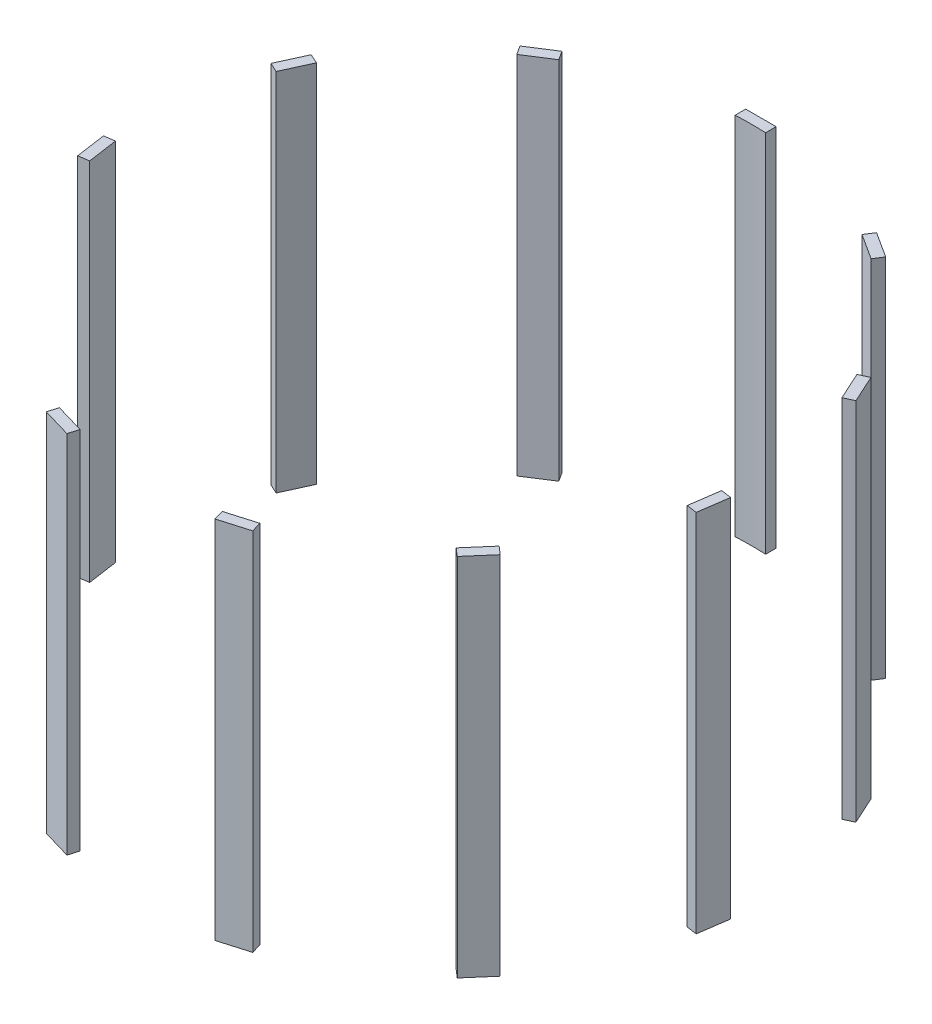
ISO-10303-21;
HEADER;
FILE_DESCRIPTION(('STEP AP214'),'2;1');
FILE_NAME('part.step','',(''),(''),'','','');
FILE_SCHEMA(('AUTOMOTIVE_DESIGN { 1 0 10303 214 1 1 1 1 }'));
ENDSEC;
DATA;
#1=APPLICATION_CONTEXT('core data for automotive mechanical design processes');
#2=APPLICATION_PROTOCOL_DEFINITION('international standard','automotive_design',2000,#1);
#3=PRODUCT_CONTEXT('',#1,'mechanical');
#4=PRODUCT('Part','Part','',(#3));
#5=PRODUCT_RELATED_PRODUCT_CATEGORY('part','',(#4));
#6=PRODUCT_DEFINITION_FORMATION('','',#4);
#7=PRODUCT_DEFINITION_CONTEXT('part definition',#1,'design');
#8=PRODUCT_DEFINITION('design','',#6,#7);
#9=PRODUCT_DEFINITION_SHAPE('','',#8);
#10=(LENGTH_UNIT() NAMED_UNIT(*) SI_UNIT(.MILLI.,.METRE.));
#11=(NAMED_UNIT(*) PLANE_ANGLE_UNIT() SI_UNIT($,.RADIAN.));
#12=(NAMED_UNIT(*) SI_UNIT($,.STERADIAN.) SOLID_ANGLE_UNIT());
#13=UNCERTAINTY_MEASURE_WITH_UNIT(LENGTH_MEASURE(1.E-05),#10,'distance_accuracy_value','');
#14=(GEOMETRIC_REPRESENTATION_CONTEXT(3) GLOBAL_UNCERTAINTY_ASSIGNED_CONTEXT((#13)) GLOBAL_UNIT_ASSIGNED_CONTEXT((#10,
#11,#12)) REPRESENTATION_CONTEXT('',''));
#15=CARTESIAN_POINT('',(0.,0.,0.));
#16=DIRECTION('',(0.,0.,1.));
#17=DIRECTION('',(1.,0.,0.));
#18=AXIS2_PLACEMENT_3D('',#15,#16,#17);
#19=CARTESIAN_POINT('',(-55.4897869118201,114.3,-77.4173497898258));
#20=DIRECTION('',(-0.541202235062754,0.,-0.840892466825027));
#21=DIRECTION('',(-0.840892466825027,0.,0.541202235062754));
#22=AXIS2_PLACEMENT_3D('',#19,#20,#21);
#23=PLANE('',#22);
#24=DIRECTION('',(0.840892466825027,0.,-0.541202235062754));
#25=VECTOR('',#24,1.);
#26=CARTESIAN_POINT('',(-55.4897869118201,0.,-77.4173497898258));
#27=LINE('',#26,#25);
#28=CARTESIAN_POINT('',(-55.4897869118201,0.,-77.4173497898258));
#29=VERTEX_POINT('',#28);
#30=CARTESIAN_POINT('',(-47.4802843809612,0.,-82.5723022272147));
#31=VERTEX_POINT('',#30);
#32=EDGE_CURVE('E12',#29,#31,#27,.T.);
#33=ORIENTED_EDGE('',*,*,#32,.T.);
#34=DIRECTION('',(0.,-1.,0.));
#35=VECTOR('',#34,1.);
#36=CARTESIAN_POINT('',(-47.4802843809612,114.3,-82.5723022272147));
#37=LINE('',#36,#35);
#38=CARTESIAN_POINT('',(-47.4802843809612,114.3,-82.5723022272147));
#39=VERTEX_POINT('',#38);
#40=EDGE_CURVE('E123',#39,#31,#37,.T.);
#41=ORIENTED_EDGE('',*,*,#40,.F.);
#42=DIRECTION('',(0.840892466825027,0.,-0.541202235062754));
#43=VECTOR('',#42,1.);
#44=CARTESIAN_POINT('',(-55.4897869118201,114.3,-77.4173497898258));
#45=LINE('',#44,#43);
#46=CARTESIAN_POINT('',(-55.4897869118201,114.3,-77.4173497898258));
#47=VERTEX_POINT('',#46);
#48=EDGE_CURVE('E56',#47,#39,#45,.T.);
#49=ORIENTED_EDGE('',*,*,#48,.F.);
#50=DIRECTION('',(0.,-1.,0.));
#51=VECTOR('',#50,1.);
#52=CARTESIAN_POINT('',(-55.4897869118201,114.3,-77.4173497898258));
#53=LINE('',#52,#51);
#54=EDGE_CURVE('E111',#47,#29,#53,.T.);
#55=ORIENTED_EDGE('',*,*,#54,.T.);
#56=EDGE_LOOP('',(#33,#41,#49,#55));
#57=FACE_BOUND('',#56,.T.);
#58=ADVANCED_FACE('F52',(#57),#23,.F.);
#59=CARTESIAN_POINT('',(-47.4802843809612,114.3,-82.5723022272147));
#60=DIRECTION('',(-0.841253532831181,0.,0.540640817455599));
#61=DIRECTION('',(0.540640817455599,0.,0.841253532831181));
#62=AXIS2_PLACEMENT_3D('',#59,#60,#61);
#63=PLANE('',#62);
#64=DIRECTION('',(-0.540640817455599,0.,-0.84125353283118));
#65=VECTOR('',#64,1.);
#66=CARTESIAN_POINT('',(-47.4802843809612,0.,-82.5723022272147));
#67=LINE('',#66,#65);
#68=CARTESIAN_POINT('',(-49.2654803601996,0.,-85.3501213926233));
#69=VERTEX_POINT('',#68);
#70=EDGE_CURVE('E62',#31,#69,#67,.T.);
#71=ORIENTED_EDGE('',*,*,#70,.T.);
#72=DIRECTION('',(0.,-1.,0.));
#73=VECTOR('',#72,1.);
#74=CARTESIAN_POINT('',(-49.2654803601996,114.3,-85.3501213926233));
#75=LINE('',#74,#73);
#76=CARTESIAN_POINT('',(-49.2654803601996,114.3,-85.3501213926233));
#77=VERTEX_POINT('',#76);
#78=EDGE_CURVE('E107',#77,#69,#75,.T.);
#79=ORIENTED_EDGE('',*,*,#78,.F.);
#80=DIRECTION('',(-0.540640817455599,0.,-0.84125353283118));
#81=VECTOR('',#80,1.);
#82=CARTESIAN_POINT('',(-47.4802843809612,114.3,-82.5723022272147));
#83=LINE('',#82,#81);
#84=EDGE_CURVE('E86',#39,#77,#83,.T.);
#85=ORIENTED_EDGE('',*,*,#84,.F.);
#86=ORIENTED_EDGE('',*,*,#40,.T.);
#87=EDGE_LOOP('',(#71,#79,#85,#86));
#88=FACE_BOUND('',#87,.T.);
#89=ADVANCED_FACE('F126',(#88),#63,.F.);
#90=CARTESIAN_POINT('',(-49.2654803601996,114.3,-85.3501213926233));
#91=DIRECTION('',(0.540640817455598,0.,0.841253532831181));
#92=DIRECTION('',(0.841253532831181,0.,-0.540640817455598));
#93=AXIS2_PLACEMENT_3D('',#90,#91,#92);
#94=PLANE('',#93);
#95=DIRECTION('',(-0.841253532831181,0.,0.540640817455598));
#96=VECTOR('',#95,1.);
#97=CARTESIAN_POINT('',(-49.2654803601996,0.,-85.3501213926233));
#98=LINE('',#97,#96);
#99=CARTESIAN_POINT('',(-57.2784202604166,0.,-80.2005176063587));
#100=VERTEX_POINT('',#99);
#101=EDGE_CURVE('E102',#69,#100,#98,.T.);
#102=ORIENTED_EDGE('',*,*,#101,.T.);
#103=DIRECTION('',(0.,-1.,0.));
#104=VECTOR('',#103,1.);
#105=CARTESIAN_POINT('',(-57.2784202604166,114.3,-80.2005176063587));
#106=LINE('',#105,#104);
#107=CARTESIAN_POINT('',(-57.2784202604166,114.3,-80.2005176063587));
#108=VERTEX_POINT('',#107);
#109=EDGE_CURVE('E105',#108,#100,#106,.T.);
#110=ORIENTED_EDGE('',*,*,#109,.F.);
#111=DIRECTION('',(-0.841253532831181,0.,0.540640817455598));
#112=VECTOR('',#111,1.);
#113=CARTESIAN_POINT('',(-49.2654803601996,114.3,-85.3501213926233));
#114=LINE('',#113,#112);
#115=EDGE_CURVE('E119',#77,#108,#114,.T.);
#116=ORIENTED_EDGE('',*,*,#115,.F.);
#117=ORIENTED_EDGE('',*,*,#78,.T.);
#118=EDGE_LOOP('',(#102,#110,#116,#117));
#119=FACE_BOUND('',#118,.T.);
#120=ADVANCED_FACE('F103',(#119),#94,.F.);
#121=CARTESIAN_POINT('',(-57.2784202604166,114.3,-80.2005176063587));
#122=DIRECTION('',(0.841253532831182,0.,-0.540640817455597));
#123=DIRECTION('',(-0.540640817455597,0.,-0.841253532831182));
#124=AXIS2_PLACEMENT_3D('',#121,#122,#123);
#125=PLANE('',#124);
#126=DIRECTION('',(0.540640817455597,0.,0.841253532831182));
#127=VECTOR('',#126,1.);
#128=CARTESIAN_POINT('',(-57.2784202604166,0.,-80.2005176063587));
#129=LINE('',#128,#127);
#130=EDGE_CURVE('E96',#100,#29,#129,.T.);
#131=ORIENTED_EDGE('',*,*,#130,.T.);
#132=ORIENTED_EDGE('',*,*,#54,.F.);
#133=DIRECTION('',(0.540640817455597,0.,0.841253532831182));
#134=VECTOR('',#133,1.);
#135=CARTESIAN_POINT('',(-57.2784202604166,114.3,-80.2005176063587));
#136=LINE('',#135,#134);
#137=EDGE_CURVE('E110',#108,#47,#136,.T.);
#138=ORIENTED_EDGE('',*,*,#137,.F.);
#139=ORIENTED_EDGE('',*,*,#109,.T.);
#140=EDGE_LOOP('',(#131,#132,#138,#139));
#141=FACE_BOUND('',#140,.T.);
#142=ADVANCED_FACE('F109',(#141),#125,.F.);
#143=CARTESIAN_POINT('',(0.,114.3,0.));
#144=DIRECTION('',(0.,1.,0.));
#145=DIRECTION('',(0.,0.,1.));
#146=AXIS2_PLACEMENT_3D('',#143,#144,#145);
#147=PLANE('',#146);
#148=ORIENTED_EDGE('',*,*,#48,.T.);
#149=ORIENTED_EDGE('',*,*,#84,.T.);
#150=ORIENTED_EDGE('',*,*,#115,.T.);
#151=ORIENTED_EDGE('',*,*,#137,.T.);
#152=EDGE_LOOP('',(#148,#149,#150,#151));
#153=FACE_BOUND('',#152,.T.);
#154=ADVANCED_FACE('F54',(#153),#147,.T.);
#155=CARTESIAN_POINT('',(0.,0.,0.));
#156=DIRECTION('',(0.,1.,0.));
#157=DIRECTION('',(0.,0.,1.));
#158=AXIS2_PLACEMENT_3D('',#155,#156,#157);
#159=PLANE('',#158);
#160=ORIENTED_EDGE('',*,*,#32,.F.);
#161=ORIENTED_EDGE('',*,*,#130,.F.);
#162=ORIENTED_EDGE('',*,*,#101,.F.);
#163=ORIENTED_EDGE('',*,*,#70,.F.);
#164=EDGE_LOOP('',(#160,#161,#162,#163));
#165=FACE_BOUND('',#164,.T.);
#166=ADVANCED_FACE('F113',(#165),#159,.F.);
#167=CLOSED_SHELL('',(#58,#89,#120,#142,#154,#166));
#168=MANIFOLD_SOLID_BREP('B2',#167);
#169=CARTESIAN_POINT('',(22.2936934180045,114.3,92.6042857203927));
#170=DIRECTION('',(0.959492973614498,0.,-0.281732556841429));
#171=DIRECTION('',(-0.281732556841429,0.,-0.959492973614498));
#172=AXIS2_PLACEMENT_3D('',#169,#170,#171);
#173=PLANE('',#172);
#174=DIRECTION('',(0.281732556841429,0.,0.959492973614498));
#175=VECTOR('',#174,1.);
#176=CARTESIAN_POINT('',(22.2936934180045,0.,92.6042857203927));
#177=LINE('',#176,#175);
#178=CARTESIAN_POINT('',(22.2936934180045,0.,92.6042857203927));
#179=VERTEX_POINT('',#178);
#180=CARTESIAN_POINT('',(23.2239743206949,0.,95.7725315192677));
#181=VERTEX_POINT('',#180);
#182=EDGE_CURVE('E50',#179,#181,#177,.T.);
#183=ORIENTED_EDGE('',*,*,#182,.T.);
#184=DIRECTION('',(0.,-1.,0.));
#185=VECTOR('',#184,1.);
#186=CARTESIAN_POINT('',(23.2239743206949,114.3,95.7725315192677));
#187=LINE('',#186,#185);
#188=CARTESIAN_POINT('',(23.2239743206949,114.3,95.7725315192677));
#189=VERTEX_POINT('',#188);
#190=EDGE_CURVE('E257',#189,#181,#187,.T.);
#191=ORIENTED_EDGE('',*,*,#190,.F.);
#192=DIRECTION('',(0.281732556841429,0.,0.959492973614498));
#193=VECTOR('',#192,1.);
#194=CARTESIAN_POINT('',(22.2936934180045,114.3,92.6042857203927));
#195=LINE('',#194,#193);
#196=CARTESIAN_POINT('',(22.2936934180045,114.3,92.6042857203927));
#197=VERTEX_POINT('',#196);
#198=EDGE_CURVE('E190',#197,#189,#195,.T.);
#199=ORIENTED_EDGE('',*,*,#198,.F.);
#200=DIRECTION('',(0.,-1.,0.));
#201=VECTOR('',#200,1.);
#202=CARTESIAN_POINT('',(22.2936934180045,114.3,92.6042857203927));
#203=LINE('',#202,#201);
#204=EDGE_CURVE('E228',#197,#179,#203,.T.);
#205=ORIENTED_EDGE('',*,*,#204,.T.);
#206=EDGE_LOOP('',(#183,#191,#199,#205));
#207=FACE_BOUND('',#206,.T.);
#208=ADVANCED_FACE('F186',(#207),#173,.F.);
#209=CARTESIAN_POINT('',(23.2239743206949,114.3,95.7725315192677));
#210=DIRECTION('',(-0.28173255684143,0.,-0.959492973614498));
#211=DIRECTION('',(-0.959492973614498,0.,0.28173255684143));
#212=AXIS2_PLACEMENT_3D('',#209,#210,#211);
#213=PLANE('',#212);
#214=DIRECTION('',(0.959492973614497,0.,-0.281732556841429));
#215=VECTOR('',#214,1.);
#216=CARTESIAN_POINT('',(23.2239743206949,0.,95.7725315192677));
#217=LINE('',#216,#215);
#218=CARTESIAN_POINT('',(32.363144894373,0.,93.0890289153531));
#219=VERTEX_POINT('',#218);
#220=EDGE_CURVE('E196',#181,#219,#217,.T.);
#221=ORIENTED_EDGE('',*,*,#220,.T.);
#222=DIRECTION('',(0.,-1.,0.));
#223=VECTOR('',#222,1.);
#224=CARTESIAN_POINT('',(32.363144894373,114.3,93.0890289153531));
#225=LINE('',#224,#223);
#226=CARTESIAN_POINT('',(32.363144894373,114.3,93.0890289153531));
#227=VERTEX_POINT('',#226);
#228=EDGE_CURVE('E243',#227,#219,#225,.T.);
#229=ORIENTED_EDGE('',*,*,#228,.F.);
#230=DIRECTION('',(0.959492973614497,0.,-0.281732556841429));
#231=VECTOR('',#230,1.);
#232=CARTESIAN_POINT('',(23.2239743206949,114.3,95.7725315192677));
#233=LINE('',#232,#231);
#234=EDGE_CURVE('E220',#189,#227,#233,.T.);
#235=ORIENTED_EDGE('',*,*,#234,.F.);
#236=ORIENTED_EDGE('',*,*,#190,.T.);
#237=EDGE_LOOP('',(#221,#229,#235,#236));
#238=FACE_BOUND('',#237,.T.);
#239=ADVANCED_FACE('F260',(#238),#213,.F.);
#240=CARTESIAN_POINT('',(32.363144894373,114.3,93.0890289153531));
#241=DIRECTION('',(-0.959492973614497,0.,0.28173255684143));
#242=DIRECTION('',(0.28173255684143,0.,0.959492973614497));
#243=AXIS2_PLACEMENT_3D('',#240,#241,#242);
#244=PLANE('',#243);
#245=DIRECTION('',(-0.28173255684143,0.,-0.959492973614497));
#246=VECTOR('',#245,1.);
#247=CARTESIAN_POINT('',(32.363144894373,0.,93.0890289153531));
#248=LINE('',#247,#246);
#249=CARTESIAN_POINT('',(31.4310727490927,0.,89.9146827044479));
#250=VERTEX_POINT('',#249);
#251=EDGE_CURVE('E246',#219,#250,#248,.T.);
#252=ORIENTED_EDGE('',*,*,#251,.T.);
#253=DIRECTION('',(0.,-1.,0.));
#254=VECTOR('',#253,1.);
#255=CARTESIAN_POINT('',(31.4310727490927,114.3,89.9146827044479));
#256=LINE('',#255,#254);
#257=CARTESIAN_POINT('',(31.4310727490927,114.3,89.9146827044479));
#258=VERTEX_POINT('',#257);
#259=EDGE_CURVE('E234',#258,#250,#256,.T.);
#260=ORIENTED_EDGE('',*,*,#259,.F.);
#261=DIRECTION('',(-0.28173255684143,0.,-0.959492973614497));
#262=VECTOR('',#261,1.);
#263=CARTESIAN_POINT('',(32.363144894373,114.3,93.0890289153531));
#264=LINE('',#263,#262);
#265=EDGE_CURVE('E255',#227,#258,#264,.T.);
#266=ORIENTED_EDGE('',*,*,#265,.F.);
#267=ORIENTED_EDGE('',*,*,#228,.T.);
#268=EDGE_LOOP('',(#252,#260,#266,#267));
#269=FACE_BOUND('',#268,.T.);
#270=ADVANCED_FACE('F247',(#269),#244,.F.);
#271=CARTESIAN_POINT('',(22.2936934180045,114.3,92.6042857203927));
#272=DIRECTION('',(-0.282372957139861,0.,-0.959304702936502));
#273=DIRECTION('',(-0.959304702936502,0.,0.282372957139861));
#274=AXIS2_PLACEMENT_3D('',#271,#272,#273);
#275=PLANE('',#274);
#276=DIRECTION('',(0.959304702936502,0.,-0.282372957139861));
#277=VECTOR('',#276,1.);
#278=CARTESIAN_POINT('',(22.2936934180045,0.,92.6042857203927));
#279=LINE('',#278,#277);
#280=EDGE_CURVE('E238',#179,#250,#279,.T.);
#281=ORIENTED_EDGE('',*,*,#280,.F.);
#282=ORIENTED_EDGE('',*,*,#204,.F.);
#283=DIRECTION('',(0.959304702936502,0.,-0.282372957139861));
#284=VECTOR('',#283,1.);
#285=CARTESIAN_POINT('',(22.2936934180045,114.3,92.6042857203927));
#286=LINE('',#285,#284);
#287=EDGE_CURVE('E240',#197,#258,#286,.T.);
#288=ORIENTED_EDGE('',*,*,#287,.T.);
#289=ORIENTED_EDGE('',*,*,#259,.T.);
#290=EDGE_LOOP('',(#281,#282,#288,#289));
#291=FACE_BOUND('',#290,.T.);
#292=ADVANCED_FACE('F236',(#291),#275,.T.);
#293=CARTESIAN_POINT('',(0.,114.3,0.));
#294=DIRECTION('',(0.,1.,0.));
#295=DIRECTION('',(0.,0.,1.));
#296=AXIS2_PLACEMENT_3D('',#293,#294,#295);
#297=PLANE('',#296);
#298=ORIENTED_EDGE('',*,*,#198,.T.);
#299=ORIENTED_EDGE('',*,*,#234,.T.);
#300=ORIENTED_EDGE('',*,*,#265,.T.);
#301=ORIENTED_EDGE('',*,*,#287,.F.);
#302=EDGE_LOOP('',(#298,#299,#300,#301));
#303=FACE_BOUND('',#302,.T.);
#304=ADVANCED_FACE('F188',(#303),#297,.T.);
#305=CARTESIAN_POINT('',(0.,0.,0.));
#306=DIRECTION('',(0.,1.,0.));
#307=DIRECTION('',(0.,0.,1.));
#308=AXIS2_PLACEMENT_3D('',#305,#306,#307);
#309=PLANE('',#308);
#310=ORIENTED_EDGE('',*,*,#182,.F.);
#311=ORIENTED_EDGE('',*,*,#280,.T.);
#312=ORIENTED_EDGE('',*,*,#251,.F.);
#313=ORIENTED_EDGE('',*,*,#220,.F.);
#314=EDGE_LOOP('',(#310,#311,#312,#313));
#315=FACE_BOUND('',#314,.T.);
#316=ADVANCED_FACE('F249',(#315),#309,.F.);
#317=CLOSED_SHELL('',(#208,#239,#270,#292,#304,#316));
#318=MANIFOLD_SOLID_BREP('B6',#317);
#319=CARTESIAN_POINT('',(68.8203050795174,114.3,65.8508018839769));
#320=DIRECTION('',(-0.756186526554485,0.,-0.65435612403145));
#321=DIRECTION('',(-0.654356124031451,0.,0.756186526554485));
#322=AXIS2_PLACEMENT_3D('',#319,#320,#321);
#323=PLANE('',#322);
#324=DIRECTION('',(0.654356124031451,0.,-0.756186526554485));
#325=VECTOR('',#324,1.);
#326=CARTESIAN_POINT('',(68.8203050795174,0.,65.8508018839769));
#327=LINE('',#326,#325);
#328=CARTESIAN_POINT('',(68.8203050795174,0.,65.8508018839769));
#329=VERTEX_POINT('',#328);
#330=CARTESIAN_POINT('',(75.0530485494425,0.,58.6481236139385));
#331=VERTEX_POINT('',#330);
#332=EDGE_CURVE('E184',#329,#331,#327,.T.);
#333=ORIENTED_EDGE('',*,*,#332,.F.);
#334=DIRECTION('',(0.,-1.,0.));
#335=VECTOR('',#334,1.);
#336=CARTESIAN_POINT('',(68.8203050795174,114.3,65.8508018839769));
#337=LINE('',#336,#335);
#338=CARTESIAN_POINT('',(68.8203050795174,114.3,65.8508018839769));
#339=VERTEX_POINT('',#338);
#340=EDGE_CURVE('E367',#339,#329,#337,.T.);
#341=ORIENTED_EDGE('',*,*,#340,.F.);
#342=DIRECTION('',(0.654356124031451,0.,-0.756186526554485));
#343=VECTOR('',#342,1.);
#344=CARTESIAN_POINT('',(68.8203050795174,114.3,65.8508018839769));
#345=LINE('',#344,#343);
#346=CARTESIAN_POINT('',(75.0530485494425,114.3,58.6481236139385));
#347=VERTEX_POINT('',#346);
#348=EDGE_CURVE('E324',#339,#347,#345,.T.);
#349=ORIENTED_EDGE('',*,*,#348,.T.);
#350=DIRECTION('',(0.,-1.,0.));
#351=VECTOR('',#350,1.);
#352=CARTESIAN_POINT('',(75.0530485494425,114.3,58.6481236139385));
#353=LINE('',#352,#351);
#354=EDGE_CURVE('E339',#347,#331,#353,.T.);
#355=ORIENTED_EDGE('',*,*,#354,.T.);
#356=EDGE_LOOP('',(#333,#341,#349,#355));
#357=FACE_BOUND('',#356,.T.);
#358=ADVANCED_FACE('F320',(#357),#323,.T.);
#359=CARTESIAN_POINT('',(68.8203050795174,114.3,65.8508018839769));
#360=DIRECTION('',(0.654860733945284,0.,-0.755749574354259));
#361=DIRECTION('',(-0.755749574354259,0.,-0.654860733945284));
#362=AXIS2_PLACEMENT_3D('',#359,#360,#361);
#363=PLANE('',#362);
#364=DIRECTION('',(0.755749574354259,0.,0.654860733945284));
#365=VECTOR('',#364,1.);
#366=CARTESIAN_POINT('',(68.8203050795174,0.,65.8508018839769));
#367=LINE('',#366,#365);
#368=CARTESIAN_POINT('',(71.3157901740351,0.,68.0131520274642));
#369=VERTEX_POINT('',#368);
#370=EDGE_CURVE('E370',#329,#369,#367,.T.);
#371=ORIENTED_EDGE('',*,*,#370,.T.);
#372=DIRECTION('',(0.,-1.,0.));
#373=VECTOR('',#372,1.);
#374=CARTESIAN_POINT('',(71.3157901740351,114.3,68.0131520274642));
#375=LINE('',#374,#373);
#376=CARTESIAN_POINT('',(71.3157901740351,114.3,68.0131520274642));
#377=VERTEX_POINT('',#376);
#378=EDGE_CURVE('E373',#377,#369,#375,.T.);
#379=ORIENTED_EDGE('',*,*,#378,.F.);
#380=DIRECTION('',(0.755749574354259,0.,0.654860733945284));
#381=VECTOR('',#380,1.);
#382=CARTESIAN_POINT('',(68.8203050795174,114.3,65.8508018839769));
#383=LINE('',#382,#381);
#384=EDGE_CURVE('E389',#339,#377,#383,.T.);
#385=ORIENTED_EDGE('',*,*,#384,.F.);
#386=ORIENTED_EDGE('',*,*,#340,.T.);
#387=EDGE_LOOP('',(#371,#379,#385,#386));
#388=FACE_BOUND('',#387,.T.);
#389=ADVANCED_FACE('F372',(#388),#363,.F.);
#390=CARTESIAN_POINT('',(71.3157901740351,114.3,68.0131520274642));
#391=DIRECTION('',(-0.755749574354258,0.,-0.654860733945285));
#392=DIRECTION('',(-0.654860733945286,0.,0.755749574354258));
#393=AXIS2_PLACEMENT_3D('',#390,#391,#392);
#394=PLANE('',#393);
#395=DIRECTION('',(0.654860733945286,0.,-0.755749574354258));
#396=VECTOR('',#395,1.);
#397=CARTESIAN_POINT('',(71.3157901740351,0.,68.0131520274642));
#398=LINE('',#397,#396);
#399=CARTESIAN_POINT('',(77.553338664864,0.,60.8146373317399));
#400=VERTEX_POINT('',#399);
#401=EDGE_CURVE('E376',#369,#400,#398,.T.);
#402=ORIENTED_EDGE('',*,*,#401,.T.);
#403=DIRECTION('',(0.,-1.,0.));
#404=VECTOR('',#403,1.);
#405=CARTESIAN_POINT('',(77.553338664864,114.3,60.8146373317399));
#406=LINE('',#405,#404);
#407=CARTESIAN_POINT('',(77.553338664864,114.3,60.8146373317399));
#408=VERTEX_POINT('',#407);
#409=EDGE_CURVE('E381',#408,#400,#406,.T.);
#410=ORIENTED_EDGE('',*,*,#409,.F.);
#411=DIRECTION('',(0.654860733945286,0.,-0.755749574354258));
#412=VECTOR('',#411,1.);
#413=CARTESIAN_POINT('',(71.3157901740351,114.3,68.0131520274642));
#414=LINE('',#413,#412);
#415=EDGE_CURVE('E356',#377,#408,#414,.T.);
#416=ORIENTED_EDGE('',*,*,#415,.F.);
#417=ORIENTED_EDGE('',*,*,#378,.T.);
#418=EDGE_LOOP('',(#402,#410,#416,#417));
#419=FACE_BOUND('',#418,.T.);
#420=ADVANCED_FACE('F379',(#419),#394,.F.);
#421=CARTESIAN_POINT('',(77.553338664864,114.3,60.8146373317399));
#422=DIRECTION('',(-0.654860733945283,0.,0.75574957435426));
#423=DIRECTION('',(0.75574957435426,0.,0.654860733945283));
#424=AXIS2_PLACEMENT_3D('',#421,#422,#423);
#425=PLANE('',#424);
#426=DIRECTION('',(-0.75574957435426,0.,-0.654860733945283));
#427=VECTOR('',#426,1.);
#428=CARTESIAN_POINT('',(77.553338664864,0.,60.8146373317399));
#429=LINE('',#428,#427);
#430=EDGE_CURVE('E330',#400,#331,#429,.T.);
#431=ORIENTED_EDGE('',*,*,#430,.T.);
#432=ORIENTED_EDGE('',*,*,#354,.F.);
#433=DIRECTION('',(-0.75574957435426,0.,-0.654860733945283));
#434=VECTOR('',#433,1.);
#435=CARTESIAN_POINT('',(77.553338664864,114.3,60.8146373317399));
#436=LINE('',#435,#434);
#437=EDGE_CURVE('E361',#408,#347,#436,.T.);
#438=ORIENTED_EDGE('',*,*,#437,.F.);
#439=ORIENTED_EDGE('',*,*,#409,.T.);
#440=EDGE_LOOP('',(#431,#432,#438,#439));
#441=FACE_BOUND('',#440,.T.);
#442=ADVANCED_FACE('F392',(#441),#425,.F.);
#443=CARTESIAN_POINT('',(0.,114.3,0.));
#444=DIRECTION('',(0.,1.,0.));
#445=DIRECTION('',(0.,0.,1.));
#446=AXIS2_PLACEMENT_3D('',#443,#444,#445);
#447=PLANE('',#446);
#448=ORIENTED_EDGE('',*,*,#348,.F.);
#449=ORIENTED_EDGE('',*,*,#384,.T.);
#450=ORIENTED_EDGE('',*,*,#415,.T.);
#451=ORIENTED_EDGE('',*,*,#437,.T.);
#452=EDGE_LOOP('',(#448,#449,#450,#451));
#453=FACE_BOUND('',#452,.T.);
#454=ADVANCED_FACE('F322',(#453),#447,.T.);
#455=CARTESIAN_POINT('',(0.,0.,0.));
#456=DIRECTION('',(0.,1.,0.));
#457=DIRECTION('',(0.,0.,1.));
#458=AXIS2_PLACEMENT_3D('',#455,#456,#457);
#459=PLANE('',#458);
#460=ORIENTED_EDGE('',*,*,#332,.T.);
#461=ORIENTED_EDGE('',*,*,#430,.F.);
#462=ORIENTED_EDGE('',*,*,#401,.F.);
#463=ORIENTED_EDGE('',*,*,#370,.F.);
#464=EDGE_LOOP('',(#460,#461,#462,#463));
#465=FACE_BOUND('',#464,.T.);
#466=ADVANCED_FACE('F384',(#465),#459,.F.);
#467=CLOSED_SHELL('',(#358,#389,#420,#442,#454,#466));
#468=MANIFOLD_SOLID_BREP('B44',#467);
#469=CARTESIAN_POINT('',(94.8462117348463,114.3,8.7611996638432));
#470=DIRECTION('',(0.989916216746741,0.,0.141654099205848));
#471=DIRECTION('',(0.141654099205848,0.,-0.989916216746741));
#472=AXIS2_PLACEMENT_3D('',#469,#470,#471);
#473=PLANE('',#472);
#474=DIRECTION('',(-0.141654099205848,0.,0.98991621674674));
#475=VECTOR('',#474,1.);
#476=CARTESIAN_POINT('',(94.8462117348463,0.,8.7611996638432));
#477=LINE('',#476,#475);
#478=CARTESIAN_POINT('',(94.8462117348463,0.,8.7611996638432));
#479=VERTEX_POINT('',#478);
#480=CARTESIAN_POINT('',(93.4969561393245,0.,18.1901537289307));
#481=VERTEX_POINT('',#480);
#482=EDGE_CURVE('E318',#479,#481,#477,.T.);
#483=ORIENTED_EDGE('',*,*,#482,.T.);
#484=DIRECTION('',(0.,-1.,0.));
#485=VECTOR('',#484,1.);
#486=CARTESIAN_POINT('',(93.4969561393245,114.3,18.1901537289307));
#487=LINE('',#486,#485);
#488=CARTESIAN_POINT('',(93.4969561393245,114.3,18.1901537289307));
#489=VERTEX_POINT('',#488);
#490=EDGE_CURVE('E525',#489,#481,#487,.T.);
#491=ORIENTED_EDGE('',*,*,#490,.F.);
#492=DIRECTION('',(-0.141654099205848,0.,0.98991621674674));
#493=VECTOR('',#492,1.);
#494=CARTESIAN_POINT('',(94.8462117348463,114.3,8.7611996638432));
#495=LINE('',#494,#493);
#496=CARTESIAN_POINT('',(94.8462117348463,114.3,8.7611996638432));
#497=VERTEX_POINT('',#496);
#498=EDGE_CURVE('E458',#497,#489,#495,.T.);
#499=ORIENTED_EDGE('',*,*,#498,.F.);
#500=DIRECTION('',(0.,-1.,0.));
#501=VECTOR('',#500,1.);
#502=CARTESIAN_POINT('',(94.8462117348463,114.3,8.7611996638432));
#503=LINE('',#502,#501);
#504=EDGE_CURVE('E513',#497,#479,#503,.T.);
#505=ORIENTED_EDGE('',*,*,#504,.T.);
#506=EDGE_LOOP('',(#483,#491,#499,#505));
#507=FACE_BOUND('',#506,.T.);
#508=ADVANCED_FACE('F454',(#507),#473,.F.);
#509=CARTESIAN_POINT('',(93.4969561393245,114.3,18.1901537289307));
#510=DIRECTION('',(0.142314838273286,0.,-0.989821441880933));
#511=DIRECTION('',(-0.989821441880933,0.,-0.142314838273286));
#512=AXIS2_PLACEMENT_3D('',#509,#510,#511);
#513=PLANE('',#512);
#514=DIRECTION('',(0.989821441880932,0.,0.142314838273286));
#515=VECTOR('',#514,1.);
#516=CARTESIAN_POINT('',(93.4969561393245,0.,18.1901537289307));
#517=LINE('',#516,#515);
#518=CARTESIAN_POINT('',(96.7653465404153,0.,18.6600773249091));
#519=VERTEX_POINT('',#518);
#520=EDGE_CURVE('E464',#481,#519,#517,.T.);
#521=ORIENTED_EDGE('',*,*,#520,.T.);
#522=DIRECTION('',(0.,-1.,0.));
#523=VECTOR('',#522,1.);
#524=CARTESIAN_POINT('',(96.7653465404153,114.3,18.6600773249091));
#525=LINE('',#524,#523);
#526=CARTESIAN_POINT('',(96.7653465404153,114.3,18.6600773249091));
#527=VERTEX_POINT('',#526);
#528=EDGE_CURVE('E509',#527,#519,#525,.T.);
#529=ORIENTED_EDGE('',*,*,#528,.F.);
#530=DIRECTION('',(0.989821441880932,0.,0.142314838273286));
#531=VECTOR('',#530,1.);
#532=CARTESIAN_POINT('',(93.4969561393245,114.3,18.1901537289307));
#533=LINE('',#532,#531);
#534=EDGE_CURVE('E488',#489,#527,#533,.T.);
#535=ORIENTED_EDGE('',*,*,#534,.F.);
#536=ORIENTED_EDGE('',*,*,#490,.T.);
#537=EDGE_LOOP('',(#521,#529,#535,#536));
#538=FACE_BOUND('',#537,.T.);
#539=ADVANCED_FACE('F528',(#538),#513,.F.);
#540=CARTESIAN_POINT('',(96.7653465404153,114.3,18.6600773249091));
#541=DIRECTION('',(-0.989821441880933,0.,-0.142314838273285));
#542=DIRECTION('',(-0.142314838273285,0.,0.989821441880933));
#543=AXIS2_PLACEMENT_3D('',#540,#541,#542);
#544=PLANE('',#543);
#545=DIRECTION('',(0.142314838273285,0.,-0.989821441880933));
#546=VECTOR('',#545,1.);
#547=CARTESIAN_POINT('',(96.7653465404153,0.,18.6600773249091));
#548=LINE('',#547,#546);
#549=CARTESIAN_POINT('',(98.1208953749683,0.,9.2320280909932));
#550=VERTEX_POINT('',#549);
#551=EDGE_CURVE('E504',#519,#550,#548,.T.);
#552=ORIENTED_EDGE('',*,*,#551,.T.);
#553=DIRECTION('',(0.,-1.,0.));
#554=VECTOR('',#553,1.);
#555=CARTESIAN_POINT('',(98.1208953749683,114.3,9.2320280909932));
#556=LINE('',#555,#554);
#557=CARTESIAN_POINT('',(98.1208953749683,114.3,9.2320280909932));
#558=VERTEX_POINT('',#557);
#559=EDGE_CURVE('E507',#558,#550,#556,.T.);
#560=ORIENTED_EDGE('',*,*,#559,.F.);
#561=DIRECTION('',(0.142314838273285,0.,-0.989821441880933));
#562=VECTOR('',#561,1.);
#563=CARTESIAN_POINT('',(96.7653465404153,114.3,18.6600773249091));
#564=LINE('',#563,#562);
#565=EDGE_CURVE('E521',#527,#558,#564,.T.);
#566=ORIENTED_EDGE('',*,*,#565,.F.);
#567=ORIENTED_EDGE('',*,*,#528,.T.);
#568=EDGE_LOOP('',(#552,#560,#566,#567));
#569=FACE_BOUND('',#568,.T.);
#570=ADVANCED_FACE('F505',(#569),#544,.F.);
#571=CARTESIAN_POINT('',(98.1208953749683,114.3,9.2320280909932));
#572=DIRECTION('',(-0.142314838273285,0.,0.989821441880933));
#573=DIRECTION('',(0.989821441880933,0.,0.142314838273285));
#574=AXIS2_PLACEMENT_3D('',#571,#572,#573);
#575=PLANE('',#574);
#576=DIRECTION('',(-0.989821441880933,0.,-0.142314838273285));
#577=VECTOR('',#576,1.);
#578=CARTESIAN_POINT('',(98.1208953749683,0.,9.2320280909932));
#579=LINE('',#578,#577);
#580=EDGE_CURVE('E498',#550,#479,#579,.T.);
#581=ORIENTED_EDGE('',*,*,#580,.T.);
#582=ORIENTED_EDGE('',*,*,#504,.F.);
#583=DIRECTION('',(-0.989821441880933,0.,-0.142314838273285));
#584=VECTOR('',#583,1.);
#585=CARTESIAN_POINT('',(98.1208953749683,114.3,9.2320280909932));
#586=LINE('',#585,#584);
#587=EDGE_CURVE('E512',#558,#497,#586,.T.);
#588=ORIENTED_EDGE('',*,*,#587,.F.);
#589=ORIENTED_EDGE('',*,*,#559,.T.);
#590=EDGE_LOOP('',(#581,#582,#588,#589));
#591=FACE_BOUND('',#590,.T.);
#592=ADVANCED_FACE('F511',(#591),#575,.F.);
#593=CARTESIAN_POINT('',(0.,114.3,0.));
#594=DIRECTION('',(0.,1.,0.));
#595=DIRECTION('',(0.,0.,1.));
#596=AXIS2_PLACEMENT_3D('',#593,#594,#595);
#597=PLANE('',#596);
#598=ORIENTED_EDGE('',*,*,#498,.T.);
#599=ORIENTED_EDGE('',*,*,#534,.T.);
#600=ORIENTED_EDGE('',*,*,#565,.T.);
#601=ORIENTED_EDGE('',*,*,#587,.T.);
#602=EDGE_LOOP('',(#598,#599,#600,#601));
#603=FACE_BOUND('',#602,.T.);
#604=ADVANCED_FACE('F456',(#603),#597,.T.);
#605=CARTESIAN_POINT('',(0.,0.,0.));
#606=DIRECTION('',(0.,1.,0.));
#607=DIRECTION('',(0.,0.,1.));
#608=AXIS2_PLACEMENT_3D('',#605,#606,#607);
#609=PLANE('',#608);
#610=ORIENTED_EDGE('',*,*,#482,.F.);
#611=ORIENTED_EDGE('',*,*,#580,.F.);
#612=ORIENTED_EDGE('',*,*,#551,.F.);
#613=ORIENTED_EDGE('',*,*,#520,.F.);
#614=EDGE_LOOP('',(#610,#611,#612,#613));
#615=FACE_BOUND('',#614,.T.);
#616=ADVANCED_FACE('F515',(#615),#609,.F.);
#617=CLOSED_SHELL('',(#508,#539,#570,#592,#604,#616));
#618=MANIFOLD_SOLID_BREP('B178',#617);
#619=CARTESIAN_POINT('',(84.5263728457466,114.3,-43.9073432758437));
#620=DIRECTION('',(0.90935450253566,0.,-0.416022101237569));
#621=DIRECTION('',(-0.416022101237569,0.,-0.90935450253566));
#622=AXIS2_PLACEMENT_3D('',#619,#620,#621);
#623=PLANE('',#622);
#624=DIRECTION('',(0.416022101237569,0.,0.90935450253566));
#625=VECTOR('',#624,1.);
#626=CARTESIAN_POINT('',(84.5263728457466,0.,-43.9073432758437));
#627=LINE('',#626,#625);
#628=CARTESIAN_POINT('',(84.5263728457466,0.,-43.9073432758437));
#629=VERTEX_POINT('',#628);
#630=CARTESIAN_POINT('',(88.4889842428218,0.,-35.2457397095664));
#631=VERTEX_POINT('',#630);
#632=EDGE_CURVE('E452',#629,#631,#627,.T.);
#633=ORIENTED_EDGE('',*,*,#632,.T.);
#634=DIRECTION('',(0.,-1.,0.));
#635=VECTOR('',#634,1.);
#636=CARTESIAN_POINT('',(88.4889842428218,114.3,-35.2457397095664));
#637=LINE('',#636,#635);
#638=CARTESIAN_POINT('',(88.4889842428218,114.3,-35.2457397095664));
#639=VERTEX_POINT('',#638);
#640=EDGE_CURVE('E659',#639,#631,#637,.T.);
#641=ORIENTED_EDGE('',*,*,#640,.F.);
#642=DIRECTION('',(0.416022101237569,0.,0.90935450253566));
#643=VECTOR('',#642,1.);
#644=CARTESIAN_POINT('',(84.5263728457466,114.3,-43.9073432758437));
#645=LINE('',#644,#643);
#646=CARTESIAN_POINT('',(84.5263728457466,114.3,-43.9073432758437));
#647=VERTEX_POINT('',#646);
#648=EDGE_CURVE('E592',#647,#639,#645,.T.);
#649=ORIENTED_EDGE('',*,*,#648,.F.);
#650=DIRECTION('',(0.,-1.,0.));
#651=VECTOR('',#650,1.);
#652=CARTESIAN_POINT('',(84.5263728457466,114.3,-43.9073432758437));
#653=LINE('',#652,#651);
#654=EDGE_CURVE('E647',#647,#629,#653,.T.);
#655=ORIENTED_EDGE('',*,*,#654,.T.);
#656=EDGE_LOOP('',(#633,#641,#649,#655));
#657=FACE_BOUND('',#656,.T.);
#658=ADVANCED_FACE('F588',(#657),#623,.F.);
#659=CARTESIAN_POINT('',(88.4889842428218,114.3,-35.2457397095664));
#660=DIRECTION('',(-0.415415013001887,0.,-0.909631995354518));
#661=DIRECTION('',(-0.909631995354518,0.,0.415415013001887));
#662=AXIS2_PLACEMENT_3D('',#659,#660,#661);
#663=PLANE('',#662);
#664=DIRECTION('',(0.909631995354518,0.,-0.415415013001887));
#665=VECTOR('',#664,1.);
#666=CARTESIAN_POINT('',(88.4889842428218,0.,-35.2457397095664));
#667=LINE('',#666,#665);
#668=CARTESIAN_POINT('',(91.4925890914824,0.,-36.6174400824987));
#669=VERTEX_POINT('',#668);
#670=EDGE_CURVE('E598',#631,#669,#667,.T.);
#671=ORIENTED_EDGE('',*,*,#670,.T.);
#672=DIRECTION('',(0.,-1.,0.));
#673=VECTOR('',#672,1.);
#674=CARTESIAN_POINT('',(91.4925890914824,114.3,-36.6174400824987));
#675=LINE('',#674,#673);
#676=CARTESIAN_POINT('',(91.4925890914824,114.3,-36.6174400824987));
#677=VERTEX_POINT('',#676);
#678=EDGE_CURVE('E643',#677,#669,#675,.T.);
#679=ORIENTED_EDGE('',*,*,#678,.F.);
#680=DIRECTION('',(0.909631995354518,0.,-0.415415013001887));
#681=VECTOR('',#680,1.);
#682=CARTESIAN_POINT('',(88.4889842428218,114.3,-35.2457397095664));
#683=LINE('',#682,#681);
#684=EDGE_CURVE('E622',#639,#677,#683,.T.);
#685=ORIENTED_EDGE('',*,*,#684,.F.);
#686=ORIENTED_EDGE('',*,*,#640,.T.);
#687=EDGE_LOOP('',(#671,#679,#685,#686));
#688=FACE_BOUND('',#687,.T.);
#689=ADVANCED_FACE('F662',(#688),#663,.F.);
#690=CARTESIAN_POINT('',(91.4925890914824,114.3,-36.6174400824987));
#691=DIRECTION('',(-0.909631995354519,0.,0.415415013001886));
#692=DIRECTION('',(0.415415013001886,0.,0.909631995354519));
#693=AXIS2_PLACEMENT_3D('',#690,#691,#692);
#694=PLANE('',#693);
#695=DIRECTION('',(-0.415415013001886,0.,-0.909631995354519));
#696=VECTOR('',#695,1.);
#697=CARTESIAN_POINT('',(91.4925890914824,0.,-36.6174400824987));
#698=LINE('',#697,#696);
#699=CARTESIAN_POINT('',(87.5357610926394,0.,-45.2816848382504));
#700=VERTEX_POINT('',#699);
#701=EDGE_CURVE('E638',#669,#700,#698,.T.);
#702=ORIENTED_EDGE('',*,*,#701,.T.);
#703=DIRECTION('',(0.,-1.,0.));
#704=VECTOR('',#703,1.);
#705=CARTESIAN_POINT('',(87.5357610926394,114.3,-45.2816848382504));
#706=LINE('',#705,#704);
#707=CARTESIAN_POINT('',(87.5357610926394,114.3,-45.2816848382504));
#708=VERTEX_POINT('',#707);
#709=EDGE_CURVE('E641',#708,#700,#706,.T.);
#710=ORIENTED_EDGE('',*,*,#709,.F.);
#711=DIRECTION('',(-0.415415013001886,0.,-0.909631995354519));
#712=VECTOR('',#711,1.);
#713=CARTESIAN_POINT('',(91.4925890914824,114.3,-36.6174400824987));
#714=LINE('',#713,#712);
#715=EDGE_CURVE('E655',#677,#708,#714,.T.);
#716=ORIENTED_EDGE('',*,*,#715,.F.);
#717=ORIENTED_EDGE('',*,*,#678,.T.);
#718=EDGE_LOOP('',(#702,#710,#716,#717));
#719=FACE_BOUND('',#718,.T.);
#720=ADVANCED_FACE('F639',(#719),#694,.F.);
#721=CARTESIAN_POINT('',(87.5357610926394,114.3,-45.2816848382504));
#722=DIRECTION('',(0.415415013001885,0.,0.909631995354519));
#723=DIRECTION('',(0.909631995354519,0.,-0.415415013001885));
#724=AXIS2_PLACEMENT_3D('',#721,#722,#723);
#725=PLANE('',#724);
#726=DIRECTION('',(-0.909631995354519,0.,0.415415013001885));
#727=VECTOR('',#726,1.);
#728=CARTESIAN_POINT('',(87.5357610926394,0.,-45.2816848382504));
#729=LINE('',#728,#727);
#730=EDGE_CURVE('E632',#700,#629,#729,.T.);
#731=ORIENTED_EDGE('',*,*,#730,.T.);
#732=ORIENTED_EDGE('',*,*,#654,.F.);
#733=DIRECTION('',(-0.909631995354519,0.,0.415415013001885));
#734=VECTOR('',#733,1.);
#735=CARTESIAN_POINT('',(87.5357610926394,114.3,-45.2816848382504));
#736=LINE('',#735,#734);
#737=EDGE_CURVE('E646',#708,#647,#736,.T.);
#738=ORIENTED_EDGE('',*,*,#737,.F.);
#739=ORIENTED_EDGE('',*,*,#709,.T.);
#740=EDGE_LOOP('',(#731,#732,#738,#739));
#741=FACE_BOUND('',#740,.T.);
#742=ADVANCED_FACE('F645',(#741),#725,.F.);
#743=CARTESIAN_POINT('',(0.,114.3,0.));
#744=DIRECTION('',(0.,1.,0.));
#745=DIRECTION('',(0.,0.,1.));
#746=AXIS2_PLACEMENT_3D('',#743,#744,#745);
#747=PLANE('',#746);
#748=ORIENTED_EDGE('',*,*,#648,.T.);
#749=ORIENTED_EDGE('',*,*,#684,.T.);
#750=ORIENTED_EDGE('',*,*,#715,.T.);
#751=ORIENTED_EDGE('',*,*,#737,.T.);
#752=EDGE_LOOP('',(#748,#749,#750,#751));
#753=FACE_BOUND('',#752,.T.);
#754=ADVANCED_FACE('F590',(#753),#747,.T.);
#755=CARTESIAN_POINT('',(0.,0.,0.));
#756=DIRECTION('',(0.,1.,0.));
#757=DIRECTION('',(0.,0.,1.));
#758=AXIS2_PLACEMENT_3D('',#755,#756,#757);
#759=PLANE('',#758);
#760=ORIENTED_EDGE('',*,*,#632,.F.);
#761=ORIENTED_EDGE('',*,*,#730,.F.);
#762=ORIENTED_EDGE('',*,*,#701,.F.);
#763=ORIENTED_EDGE('',*,*,#670,.F.);
#764=EDGE_LOOP('',(#760,#761,#762,#763));
#765=FACE_BOUND('',#764,.T.);
#766=ADVANCED_FACE('F649',(#765),#759,.F.);
#767=CLOSED_SHELL('',(#658,#689,#720,#742,#754,#766));
#768=MANIFOLD_SOLID_BREP('B312',#767);
#769=CARTESIAN_POINT('',(47.3700078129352,114.3,-82.6356149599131));
#770=DIRECTION('',(0.54007915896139,0.,-0.841614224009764));
#771=DIRECTION('',(-0.841614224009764,0.,-0.54007915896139));
#772=AXIS2_PLACEMENT_3D('',#769,#770,#771);
#773=PLANE('',#772);
#774=DIRECTION('',(0.841614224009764,0.,0.54007915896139));
#775=VECTOR('',#774,1.);
#776=CARTESIAN_POINT('',(47.3700078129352,0.,-82.6356149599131));
#777=LINE('',#776,#775);
#778=CARTESIAN_POINT('',(47.3700078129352,0.,-82.6356149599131));
#779=VERTEX_POINT('',#778);
#780=CARTESIAN_POINT('',(55.3863850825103,0.,-77.4913598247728));
#781=VERTEX_POINT('',#780);
#782=EDGE_CURVE('E586',#779,#781,#777,.T.);
#783=ORIENTED_EDGE('',*,*,#782,.T.);
#784=DIRECTION('',(0.,-1.,0.));
#785=VECTOR('',#784,1.);
#786=CARTESIAN_POINT('',(55.3863850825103,114.3,-77.4913598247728));
#787=LINE('',#786,#785);
#788=CARTESIAN_POINT('',(55.3863850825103,114.3,-77.4913598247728));
#789=VERTEX_POINT('',#788);
#790=EDGE_CURVE('E793',#789,#781,#787,.T.);
#791=ORIENTED_EDGE('',*,*,#790,.F.);
#792=DIRECTION('',(0.841614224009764,0.,0.54007915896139));
#793=VECTOR('',#792,1.);
#794=CARTESIAN_POINT('',(47.3700078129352,114.3,-82.6356149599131));
#795=LINE('',#794,#793);
#796=CARTESIAN_POINT('',(47.3700078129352,114.3,-82.6356149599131));
#797=VERTEX_POINT('',#796);
#798=EDGE_CURVE('E726',#797,#789,#795,.T.);
#799=ORIENTED_EDGE('',*,*,#798,.F.);
#800=DIRECTION('',(0.,-1.,0.));
#801=VECTOR('',#800,1.);
#802=CARTESIAN_POINT('',(47.3700078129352,114.3,-82.6356149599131));
#803=LINE('',#802,#801);
#804=EDGE_CURVE('E781',#797,#779,#803,.T.);
#805=ORIENTED_EDGE('',*,*,#804,.T.);
#806=EDGE_LOOP('',(#783,#791,#799,#805));
#807=FACE_BOUND('',#806,.T.);
#808=ADVANCED_FACE('F722',(#807),#773,.F.);
#809=CARTESIAN_POINT('',(55.3863850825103,114.3,-77.4913598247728));
#810=DIRECTION('',(-0.841253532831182,0.,-0.540640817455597));
#811=DIRECTION('',(-0.540640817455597,0.,0.841253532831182));
#812=AXIS2_PLACEMENT_3D('',#809,#810,#811);
#813=PLANE('',#812);
#814=DIRECTION('',(0.540640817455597,0.,-0.841253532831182));
#815=VECTOR('',#814,1.);
#816=CARTESIAN_POINT('',(55.3863850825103,0.,-77.4913598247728));
#817=LINE('',#816,#815);
#818=CARTESIAN_POINT('',(57.1715810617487,0.,-80.2691789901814));
#819=VERTEX_POINT('',#818);
#820=EDGE_CURVE('E732',#781,#819,#817,.T.);
#821=ORIENTED_EDGE('',*,*,#820,.T.);
#822=DIRECTION('',(0.,-1.,0.));
#823=VECTOR('',#822,1.);
#824=CARTESIAN_POINT('',(57.1715810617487,114.3,-80.2691789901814));
#825=LINE('',#824,#823);
#826=CARTESIAN_POINT('',(57.1715810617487,114.3,-80.2691789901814));
#827=VERTEX_POINT('',#826);
#828=EDGE_CURVE('E777',#827,#819,#825,.T.);
#829=ORIENTED_EDGE('',*,*,#828,.F.);
#830=DIRECTION('',(0.540640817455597,0.,-0.841253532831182));
#831=VECTOR('',#830,1.);
#832=CARTESIAN_POINT('',(55.3863850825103,114.3,-77.4913598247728));
#833=LINE('',#832,#831);
#834=EDGE_CURVE('E756',#789,#827,#833,.T.);
#835=ORIENTED_EDGE('',*,*,#834,.F.);
#836=ORIENTED_EDGE('',*,*,#790,.T.);
#837=EDGE_LOOP('',(#821,#829,#835,#836));
#838=FACE_BOUND('',#837,.T.);
#839=ADVANCED_FACE('F796',(#838),#813,.F.);
#840=CARTESIAN_POINT('',(57.1715810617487,114.3,-80.2691789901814));
#841=DIRECTION('',(-0.540640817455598,0.,0.841253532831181));
#842=DIRECTION('',(0.841253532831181,0.,0.540640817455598));
#843=AXIS2_PLACEMENT_3D('',#840,#841,#842);
#844=PLANE('',#843);
#845=DIRECTION('',(-0.841253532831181,0.,-0.540640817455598));
#846=VECTOR('',#845,1.);
#847=CARTESIAN_POINT('',(57.1715810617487,0.,-80.2691789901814));
#848=LINE('',#847,#846);
#849=CARTESIAN_POINT('',(49.1586411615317,0.,-85.418782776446));
#850=VERTEX_POINT('',#849);
#851=EDGE_CURVE('E772',#819,#850,#848,.T.);
#852=ORIENTED_EDGE('',*,*,#851,.T.);
#853=DIRECTION('',(0.,-1.,0.));
#854=VECTOR('',#853,1.);
#855=CARTESIAN_POINT('',(49.1586411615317,114.3,-85.418782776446));
#856=LINE('',#855,#854);
#857=CARTESIAN_POINT('',(49.1586411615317,114.3,-85.418782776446));
#858=VERTEX_POINT('',#857);
#859=EDGE_CURVE('E775',#858,#850,#856,.T.);
#860=ORIENTED_EDGE('',*,*,#859,.F.);
#861=DIRECTION('',(-0.841253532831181,0.,-0.540640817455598));
#862=VECTOR('',#861,1.);
#863=CARTESIAN_POINT('',(57.1715810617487,114.3,-80.2691789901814));
#864=LINE('',#863,#862);
#865=EDGE_CURVE('E789',#827,#858,#864,.T.);
#866=ORIENTED_EDGE('',*,*,#865,.F.);
#867=ORIENTED_EDGE('',*,*,#828,.T.);
#868=EDGE_LOOP('',(#852,#860,#866,#867));
#869=FACE_BOUND('',#868,.T.);
#870=ADVANCED_FACE('F773',(#869),#844,.F.);
#871=CARTESIAN_POINT('',(49.1586411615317,114.3,-85.418782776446));
#872=DIRECTION('',(0.841253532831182,0.,0.540640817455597));
#873=DIRECTION('',(0.540640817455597,0.,-0.841253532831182));
#874=AXIS2_PLACEMENT_3D('',#871,#872,#873);
#875=PLANE('',#874);
#876=DIRECTION('',(-0.540640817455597,0.,0.841253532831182));
#877=VECTOR('',#876,1.);
#878=CARTESIAN_POINT('',(49.1586411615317,0.,-85.418782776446));
#879=LINE('',#878,#877);
#880=EDGE_CURVE('E766',#850,#779,#879,.T.);
#881=ORIENTED_EDGE('',*,*,#880,.T.);
#882=ORIENTED_EDGE('',*,*,#804,.F.);
#883=DIRECTION('',(-0.540640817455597,0.,0.841253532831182));
#884=VECTOR('',#883,1.);
#885=CARTESIAN_POINT('',(49.1586411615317,114.3,-85.418782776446));
#886=LINE('',#885,#884);
#887=EDGE_CURVE('E780',#858,#797,#886,.T.);
#888=ORIENTED_EDGE('',*,*,#887,.F.);
#889=ORIENTED_EDGE('',*,*,#859,.T.);
#890=EDGE_LOOP('',(#881,#882,#888,#889));
#891=FACE_BOUND('',#890,.T.);
#892=ADVANCED_FACE('F779',(#891),#875,.F.);
#893=CARTESIAN_POINT('',(0.,114.3,0.));
#894=DIRECTION('',(0.,1.,0.));
#895=DIRECTION('',(0.,0.,1.));
#896=AXIS2_PLACEMENT_3D('',#893,#894,#895);
#897=PLANE('',#896);
#898=ORIENTED_EDGE('',*,*,#798,.T.);
#899=ORIENTED_EDGE('',*,*,#834,.T.);
#900=ORIENTED_EDGE('',*,*,#865,.T.);
#901=ORIENTED_EDGE('',*,*,#887,.T.);
#902=EDGE_LOOP('',(#898,#899,#900,#901));
#903=FACE_BOUND('',#902,.T.);
#904=ADVANCED_FACE('F724',(#903),#897,.T.);
#905=CARTESIAN_POINT('',(0.,0.,0.));
#906=DIRECTION('',(0.,1.,0.));
#907=DIRECTION('',(0.,0.,1.));
#908=AXIS2_PLACEMENT_3D('',#905,#906,#907);
#909=PLANE('',#908);
#910=ORIENTED_EDGE('',*,*,#782,.F.);
#911=ORIENTED_EDGE('',*,*,#880,.F.);
#912=ORIENTED_EDGE('',*,*,#851,.F.);
#913=ORIENTED_EDGE('',*,*,#820,.F.);
#914=EDGE_LOOP('',(#910,#911,#912,#913));
#915=FACE_BOUND('',#914,.T.);
#916=ADVANCED_FACE('F783',(#915),#909,.F.);
#917=CLOSED_SHELL('',(#808,#839,#870,#892,#904,#916));
#918=MANIFOLD_SOLID_BREP('B446',#917);
#919=CARTESIAN_POINT('',(-84.5849139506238,114.3,-43.7944612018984));
#920=DIRECTION('',(-0.415415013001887,0.,0.909631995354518));
#921=DIRECTION('',(0.909631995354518,0.,0.415415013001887));
#922=AXIS2_PLACEMENT_3D('',#919,#920,#921);
#923=PLANE('',#922);
#924=DIRECTION('',(-0.909631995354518,0.,-0.415415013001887));
#925=VECTOR('',#924,1.);
#926=CARTESIAN_POINT('',(-84.5849139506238,0.,-43.7944612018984));
#927=LINE('',#926,#925);
#928=CARTESIAN_POINT('',(-84.5849139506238,0.,-43.7944612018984));
#929=VERTEX_POINT('',#928);
#930=CARTESIAN_POINT('',(-87.5885187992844,0.,-45.1661615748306));
#931=VERTEX_POINT('',#930);
#932=EDGE_CURVE('E720',#929,#931,#927,.T.);
#933=ORIENTED_EDGE('',*,*,#932,.T.);
#934=DIRECTION('',(0.,-1.,0.));
#935=VECTOR('',#934,1.);
#936=CARTESIAN_POINT('',(-87.5885187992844,114.3,-45.1661615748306));
#937=LINE('',#936,#935);
#938=CARTESIAN_POINT('',(-87.5885187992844,114.3,-45.1661615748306));
#939=VERTEX_POINT('',#938);
#940=EDGE_CURVE('E936',#939,#931,#937,.T.);
#941=ORIENTED_EDGE('',*,*,#940,.F.);
#942=DIRECTION('',(-0.909631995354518,0.,-0.415415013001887));
#943=VECTOR('',#942,1.);
#944=CARTESIAN_POINT('',(-84.5849139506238,114.3,-43.7944612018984));
#945=LINE('',#944,#943);
#946=CARTESIAN_POINT('',(-84.5849139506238,114.3,-43.7944612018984));
#947=VERTEX_POINT('',#946);
#948=EDGE_CURVE('E860',#947,#939,#945,.T.);
#949=ORIENTED_EDGE('',*,*,#948,.F.);
#950=DIRECTION('',(0.,-1.,0.));
#951=VECTOR('',#950,1.);
#952=CARTESIAN_POINT('',(-84.5849139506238,114.3,-43.7944612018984));
#953=LINE('',#952,#951);
#954=EDGE_CURVE('E918',#947,#929,#953,.T.);
#955=ORIENTED_EDGE('',*,*,#954,.T.);
#956=EDGE_LOOP('',(#933,#941,#949,#955));
#957=FACE_BOUND('',#956,.T.);
#958=ADVANCED_FACE('F856',(#957),#923,.F.);
#959=CARTESIAN_POINT('',(-87.5885187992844,114.3,-45.1661615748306));
#960=DIRECTION('',(0.909631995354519,0.,0.415415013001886));
#961=DIRECTION('',(0.415415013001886,0.,-0.909631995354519));
#962=AXIS2_PLACEMENT_3D('',#959,#960,#961);
#963=PLANE('',#962);
#964=DIRECTION('',(-0.415415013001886,0.,0.909631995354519));
#965=VECTOR('',#964,1.);
#966=CARTESIAN_POINT('',(-87.5885187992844,0.,-45.1661615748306));
#967=LINE('',#966,#965);
#968=CARTESIAN_POINT('',(-91.5453467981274,0.,-36.5019168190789));
#969=VERTEX_POINT('',#968);
#970=EDGE_CURVE('E867',#931,#969,#967,.T.);
#971=ORIENTED_EDGE('',*,*,#970,.T.);
#972=DIRECTION('',(0.,-1.,0.));
#973=VECTOR('',#972,1.);
#974=CARTESIAN_POINT('',(-91.5453467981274,114.3,-36.5019168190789));
#975=LINE('',#974,#973);
#976=CARTESIAN_POINT('',(-91.5453467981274,114.3,-36.5019168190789));
#977=VERTEX_POINT('',#976);
#978=EDGE_CURVE('E912',#977,#969,#975,.T.);
#979=ORIENTED_EDGE('',*,*,#978,.F.);
#980=DIRECTION('',(-0.415415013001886,0.,0.909631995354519));
#981=VECTOR('',#980,1.);
#982=CARTESIAN_POINT('',(-87.5885187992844,114.3,-45.1661615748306));
#983=LINE('',#982,#981);
#984=EDGE_CURVE('E891',#939,#977,#983,.T.);
#985=ORIENTED_EDGE('',*,*,#984,.F.);
#986=ORIENTED_EDGE('',*,*,#940,.T.);
#987=EDGE_LOOP('',(#971,#979,#985,#986));
#988=FACE_BOUND('',#987,.T.);
#989=ADVANCED_FACE('F940',(#988),#963,.F.);
#990=CARTESIAN_POINT('',(-91.5453467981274,114.3,-36.5019168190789));
#991=DIRECTION('',(0.415415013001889,0.,-0.909631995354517));
#992=DIRECTION('',(-0.909631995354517,0.,-0.415415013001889));
#993=AXIS2_PLACEMENT_3D('',#990,#991,#992);
#994=PLANE('',#993);
#995=DIRECTION('',(0.909631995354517,0.,0.415415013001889));
#996=VECTOR('',#995,1.);
#997=CARTESIAN_POINT('',(-91.5453467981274,0.,-36.5019168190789));
#998=LINE('',#997,#996);
#999=CARTESIAN_POINT('',(-88.5359585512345,0.,-35.1275752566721));
#1000=VERTEX_POINT('',#999);
#1001=EDGE_CURVE('E907',#969,#1000,#998,.T.);
#1002=ORIENTED_EDGE('',*,*,#1001,.T.);
#1003=DIRECTION('',(0.,-1.,0.));
#1004=VECTOR('',#1003,1.);
#1005=CARTESIAN_POINT('',(-88.5359585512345,114.3,-35.1275752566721));
#1006=LINE('',#1005,#1004);
#1007=CARTESIAN_POINT('',(-88.5359585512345,114.3,-35.1275752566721));
#1008=VERTEX_POINT('',#1007);
#1009=EDGE_CURVE('E910',#1008,#1000,#1006,.T.);
#1010=ORIENTED_EDGE('',*,*,#1009,.F.);
#1011=DIRECTION('',(0.909631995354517,0.,0.415415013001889));
#1012=VECTOR('',#1011,1.);
#1013=CARTESIAN_POINT('',(-91.5453467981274,114.3,-36.5019168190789));
#1014=LINE('',#1013,#1012);
#1015=EDGE_CURVE('E930',#977,#1008,#1014,.T.);
#1016=ORIENTED_EDGE('',*,*,#1015,.F.);
#1017=ORIENTED_EDGE('',*,*,#978,.T.);
#1018=EDGE_LOOP('',(#1002,#1010,#1016,#1017));
#1019=FACE_BOUND('',#1018,.T.);
#1020=ADVANCED_FACE('F908',(#1019),#994,.F.);
#1021=CARTESIAN_POINT('',(-88.5359585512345,114.3,-35.1275752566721));
#1022=DIRECTION('',(-0.90990908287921,0.,-0.414807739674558));
#1023=DIRECTION('',(-0.414807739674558,0.,0.90990908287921));
#1024=AXIS2_PLACEMENT_3D('',#1021,#1022,#1023);
#1025=PLANE('',#1024);
#1026=DIRECTION('',(0.414807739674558,0.,-0.90990908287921));
#1027=VECTOR('',#1026,1.);
#1028=CARTESIAN_POINT('',(-88.5359585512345,0.,-35.1275752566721));
#1029=LINE('',#1028,#1027);
#1030=EDGE_CURVE('E901',#1000,#929,#1029,.T.);
#1031=ORIENTED_EDGE('',*,*,#1030,.T.);
#1032=ORIENTED_EDGE('',*,*,#954,.F.);
#1033=DIRECTION('',(0.414807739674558,0.,-0.90990908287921));
#1034=VECTOR('',#1033,1.);
#1035=CARTESIAN_POINT('',(-88.5359585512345,114.3,-35.1275752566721));
#1036=LINE('',#1035,#1034);
#1037=EDGE_CURVE('E916',#1008,#947,#1036,.T.);
#1038=ORIENTED_EDGE('',*,*,#1037,.F.);
#1039=ORIENTED_EDGE('',*,*,#1009,.T.);
#1040=EDGE_LOOP('',(#1031,#1032,#1038,#1039));
#1041=FACE_BOUND('',#1040,.T.);
#1042=ADVANCED_FACE('F915',(#1041),#1025,.F.);
#1043=CARTESIAN_POINT('',(0.,114.3,0.));
#1044=DIRECTION('',(0.,1.,0.));
#1045=DIRECTION('',(0.,0.,1.));
#1046=AXIS2_PLACEMENT_3D('',#1043,#1044,#1045);
#1047=PLANE('',#1046);
#1048=ORIENTED_EDGE('',*,*,#948,.T.);
#1049=ORIENTED_EDGE('',*,*,#984,.T.);
#1050=ORIENTED_EDGE('',*,*,#1015,.T.);
#1051=ORIENTED_EDGE('',*,*,#1037,.T.);
#1052=EDGE_LOOP('',(#1048,#1049,#1050,#1051));
#1053=FACE_BOUND('',#1052,.T.);
#1054=ADVANCED_FACE('F858',(#1053),#1047,.T.);
#1055=CARTESIAN_POINT('',(0.,0.,0.));
#1056=DIRECTION('',(0.,1.,0.));
#1057=DIRECTION('',(0.,0.,1.));
#1058=AXIS2_PLACEMENT_3D('',#1055,#1056,#1057);
#1059=PLANE('',#1058);
#1060=ORIENTED_EDGE('',*,*,#932,.F.);
#1061=ORIENTED_EDGE('',*,*,#1030,.F.);
#1062=ORIENTED_EDGE('',*,*,#1001,.F.);
#1063=ORIENTED_EDGE('',*,*,#970,.F.);
#1064=EDGE_LOOP('',(#1060,#1061,#1062,#1063));
#1065=FACE_BOUND('',#1064,.T.);
#1066=ADVANCED_FACE('F920',(#1065),#1059,.F.);
#1067=CLOSED_SHELL('',(#958,#989,#1020,#1042,#1054,#1066));
#1068=MANIFOLD_SOLID_BREP('B580',#1067);
#1069=CARTESIAN_POINT('',(-94.8344309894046,114.3,8.88781181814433));
#1070=DIRECTION('',(0.142314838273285,0.,0.989821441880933));
#1071=DIRECTION('',(0.989821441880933,0.,-0.142314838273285));
#1072=AXIS2_PLACEMENT_3D('',#1069,#1070,#1071);
#1073=PLANE('',#1072);
#1074=DIRECTION('',(-0.989821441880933,0.,0.142314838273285));
#1075=VECTOR('',#1074,1.);
#1076=CARTESIAN_POINT('',(-94.8344309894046,0.,8.88781181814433));
#1077=LINE('',#1076,#1075);
#1078=CARTESIAN_POINT('',(-94.8344309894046,0.,8.88781181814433));
#1079=VERTEX_POINT('',#1078);
#1080=CARTESIAN_POINT('',(-98.1028213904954,0.,9.35773541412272));
#1081=VERTEX_POINT('',#1080);
#1082=EDGE_CURVE('E854',#1079,#1081,#1077,.T.);
#1083=ORIENTED_EDGE('',*,*,#1082,.T.);
#1084=DIRECTION('',(0.,-1.,0.));
#1085=VECTOR('',#1084,1.);
#1086=CARTESIAN_POINT('',(-98.1028213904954,114.3,9.35773541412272));
#1087=LINE('',#1086,#1085);
#1088=CARTESIAN_POINT('',(-98.1028213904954,114.3,9.35773541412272));
#1089=VERTEX_POINT('',#1088);
#1090=EDGE_CURVE('E1073',#1089,#1081,#1087,.T.);
#1091=ORIENTED_EDGE('',*,*,#1090,.F.);
#1092=DIRECTION('',(-0.989821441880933,0.,0.142314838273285));
#1093=VECTOR('',#1092,1.);
#1094=CARTESIAN_POINT('',(-94.8344309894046,114.3,8.88781181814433));
#1095=LINE('',#1094,#1093);
#1096=CARTESIAN_POINT('',(-94.8344309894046,114.3,8.88781181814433));
#1097=VERTEX_POINT('',#1096);
#1098=EDGE_CURVE('E1006',#1097,#1089,#1095,.T.);
#1099=ORIENTED_EDGE('',*,*,#1098,.F.);
#1100=DIRECTION('',(0.,-1.,0.));
#1101=VECTOR('',#1100,1.);
#1102=CARTESIAN_POINT('',(-94.8344309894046,114.3,8.88781181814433));
#1103=LINE('',#1102,#1101);
#1104=EDGE_CURVE('E1061',#1097,#1079,#1103,.T.);
#1105=ORIENTED_EDGE('',*,*,#1104,.T.);
#1106=EDGE_LOOP('',(#1083,#1091,#1099,#1105));
#1107=FACE_BOUND('',#1106,.T.);
#1108=ADVANCED_FACE('F1002',(#1107),#1073,.F.);
#1109=CARTESIAN_POINT('',(-98.1028213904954,114.3,9.35773541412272));
#1110=DIRECTION('',(0.989821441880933,0.,-0.142314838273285));
#1111=DIRECTION('',(-0.142314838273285,0.,-0.989821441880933));
#1112=AXIS2_PLACEMENT_3D('',#1109,#1110,#1111);
#1113=PLANE('',#1112);
#1114=DIRECTION('',(0.142314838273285,0.,0.989821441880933));
#1115=VECTOR('',#1114,1.);
#1116=CARTESIAN_POINT('',(-98.1028213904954,0.,9.35773541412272));
#1117=LINE('',#1116,#1115);
#1118=CARTESIAN_POINT('',(-96.7472725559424,0.,18.7857846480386));
#1119=VERTEX_POINT('',#1118);
#1120=EDGE_CURVE('E1012',#1081,#1119,#1117,.T.);
#1121=ORIENTED_EDGE('',*,*,#1120,.T.);
#1122=DIRECTION('',(0.,-1.,0.));
#1123=VECTOR('',#1122,1.);
#1124=CARTESIAN_POINT('',(-96.7472725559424,114.3,18.7857846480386));
#1125=LINE('',#1124,#1123);
#1126=CARTESIAN_POINT('',(-96.7472725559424,114.3,18.7857846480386));
#1127=VERTEX_POINT('',#1126);
#1128=EDGE_CURVE('E1057',#1127,#1119,#1125,.T.);
#1129=ORIENTED_EDGE('',*,*,#1128,.F.);
#1130=DIRECTION('',(0.142314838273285,0.,0.989821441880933));
#1131=VECTOR('',#1130,1.);
#1132=CARTESIAN_POINT('',(-98.1028213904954,114.3,9.35773541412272));
#1133=LINE('',#1132,#1131);
#1134=EDGE_CURVE('E1036',#1089,#1127,#1133,.T.);
#1135=ORIENTED_EDGE('',*,*,#1134,.F.);
#1136=ORIENTED_EDGE('',*,*,#1090,.T.);
#1137=EDGE_LOOP('',(#1121,#1129,#1135,#1136));
#1138=FACE_BOUND('',#1137,.T.);
#1139=ADVANCED_FACE('F1076',(#1138),#1113,.F.);
#1140=CARTESIAN_POINT('',(-96.7472725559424,114.3,18.7857846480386));
#1141=DIRECTION('',(-0.142314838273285,0.,-0.989821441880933));
#1142=DIRECTION('',(-0.989821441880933,0.,0.142314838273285));
#1143=AXIS2_PLACEMENT_3D('',#1140,#1141,#1142);
#1144=PLANE('',#1143);
#1145=DIRECTION('',(0.989821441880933,0.,-0.142314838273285));
#1146=VECTOR('',#1145,1.);
#1147=CARTESIAN_POINT('',(-96.7472725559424,0.,18.7857846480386));
#1148=LINE('',#1147,#1146);
#1149=CARTESIAN_POINT('',(-93.4725889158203,0.,18.3149562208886));
#1150=VERTEX_POINT('',#1149);
#1151=EDGE_CURVE('E1052',#1119,#1150,#1148,.T.);
#1152=ORIENTED_EDGE('',*,*,#1151,.T.);
#1153=DIRECTION('',(0.,-1.,0.));
#1154=VECTOR('',#1153,1.);
#1155=CARTESIAN_POINT('',(-93.4725889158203,114.3,18.3149562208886));
#1156=LINE('',#1155,#1154);
#1157=CARTESIAN_POINT('',(-93.4725889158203,114.3,18.3149562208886));
#1158=VERTEX_POINT('',#1157);
#1159=EDGE_CURVE('E1055',#1158,#1150,#1156,.T.);
#1160=ORIENTED_EDGE('',*,*,#1159,.F.);
#1161=DIRECTION('',(0.989821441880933,0.,-0.142314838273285));
#1162=VECTOR('',#1161,1.);
#1163=CARTESIAN_POINT('',(-96.7472725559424,114.3,18.7857846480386));
#1164=LINE('',#1163,#1162);
#1165=EDGE_CURVE('E1069',#1127,#1158,#1164,.T.);
#1166=ORIENTED_EDGE('',*,*,#1165,.F.);
#1167=ORIENTED_EDGE('',*,*,#1128,.T.);
#1168=EDGE_LOOP('',(#1152,#1160,#1166,#1167));
#1169=FACE_BOUND('',#1168,.T.);
#1170=ADVANCED_FACE('F1053',(#1169),#1144,.F.);
#1171=CARTESIAN_POINT('',(-93.4725889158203,114.3,18.3149562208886));
#1172=DIRECTION('',(-0.989726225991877,0.,0.142975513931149));
#1173=DIRECTION('',(0.142975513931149,0.,0.989726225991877));
#1174=AXIS2_PLACEMENT_3D('',#1171,#1172,#1173);
#1175=PLANE('',#1174);
#1176=DIRECTION('',(-0.142975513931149,0.,-0.989726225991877));
#1177=VECTOR('',#1176,1.);
#1178=CARTESIAN_POINT('',(-93.4725889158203,0.,18.3149562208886));
#1179=LINE('',#1178,#1177);
#1180=EDGE_CURVE('E1046',#1150,#1079,#1179,.T.);
#1181=ORIENTED_EDGE('',*,*,#1180,.T.);
#1182=ORIENTED_EDGE('',*,*,#1104,.F.);
#1183=DIRECTION('',(-0.142975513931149,0.,-0.989726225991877));
#1184=VECTOR('',#1183,1.);
#1185=CARTESIAN_POINT('',(-93.4725889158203,114.3,18.3149562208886));
#1186=LINE('',#1185,#1184);
#1187=EDGE_CURVE('E1060',#1158,#1097,#1186,.T.);
#1188=ORIENTED_EDGE('',*,*,#1187,.F.);
#1189=ORIENTED_EDGE('',*,*,#1159,.T.);
#1190=EDGE_LOOP('',(#1181,#1182,#1188,#1189));
#1191=FACE_BOUND('',#1190,.T.);
#1192=ADVANCED_FACE('F1059',(#1191),#1175,.F.);
#1193=CARTESIAN_POINT('',(0.,114.3,0.));
#1194=DIRECTION('',(0.,1.,0.));
#1195=DIRECTION('',(0.,0.,1.));
#1196=AXIS2_PLACEMENT_3D('',#1193,#1194,#1195);
#1197=PLANE('',#1196);
#1198=ORIENTED_EDGE('',*,*,#1098,.T.);
#1199=ORIENTED_EDGE('',*,*,#1134,.T.);
#1200=ORIENTED_EDGE('',*,*,#1165,.T.);
#1201=ORIENTED_EDGE('',*,*,#1187,.T.);
#1202=EDGE_LOOP('',(#1198,#1199,#1200,#1201));
#1203=FACE_BOUND('',#1202,.T.);
#1204=ADVANCED_FACE('F1004',(#1203),#1197,.T.);
#1205=CARTESIAN_POINT('',(0.,0.,0.));
#1206=DIRECTION('',(0.,1.,0.));
#1207=DIRECTION('',(0.,0.,1.));
#1208=AXIS2_PLACEMENT_3D('',#1205,#1206,#1207);
#1209=PLANE('',#1208);
#1210=ORIENTED_EDGE('',*,*,#1082,.F.);
#1211=ORIENTED_EDGE('',*,*,#1180,.F.);
#1212=ORIENTED_EDGE('',*,*,#1151,.F.);
#1213=ORIENTED_EDGE('',*,*,#1120,.F.);
#1214=EDGE_LOOP('',(#1210,#1211,#1212,#1213));
#1215=FACE_BOUND('',#1214,.T.);
#1216=ADVANCED_FACE('F1063',(#1215),#1209,.F.);
#1217=CLOSED_SHELL('',(#1108,#1139,#1170,#1192,#1204,#1216));
#1218=MANIFOLD_SOLID_BREP('B714',#1217);
#1219=CARTESIAN_POINT('',(-31.3110083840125,114.3,89.9565631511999));
#1220=DIRECTION('',(0.281092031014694,0.,-0.959680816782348));
#1221=DIRECTION('',(-0.959680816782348,0.,-0.281092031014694));
#1222=AXIS2_PLACEMENT_3D('',#1219,#1220,#1221);
#1223=PLANE('',#1222);
#1224=DIRECTION('',(0.959680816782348,0.,0.281092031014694));
#1225=VECTOR('',#1224,1.);
#1226=CARTESIAN_POINT('',(-31.3110083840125,0.,89.9565631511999));
#1227=LINE('',#1226,#1225);
#1228=CARTESIAN_POINT('',(-31.3110083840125,0.,89.9565631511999));
#1229=VERTEX_POINT('',#1228);
#1230=CARTESIAN_POINT('',(-22.1700465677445,0.,92.6339653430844));
#1231=VERTEX_POINT('',#1230);
#1232=EDGE_CURVE('E1000',#1229,#1231,#1227,.T.);
#1233=ORIENTED_EDGE('',*,*,#1232,.F.);
#1234=DIRECTION('',(0.,-1.,0.));
#1235=VECTOR('',#1234,1.);
#1236=CARTESIAN_POINT('',(-31.3110083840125,114.3,89.9565631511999));
#1237=LINE('',#1236,#1235);
#1238=CARTESIAN_POINT('',(-31.3110083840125,114.3,89.9565631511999));
#1239=VERTEX_POINT('',#1238);
#1240=EDGE_CURVE('E1182',#1239,#1229,#1237,.T.);
#1241=ORIENTED_EDGE('',*,*,#1240,.F.);
#1242=DIRECTION('',(0.959680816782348,0.,0.281092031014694));
#1243=VECTOR('',#1242,1.);
#1244=CARTESIAN_POINT('',(-31.3110083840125,114.3,89.9565631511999));
#1245=LINE('',#1244,#1243);
#1246=CARTESIAN_POINT('',(-22.1700465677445,114.3,92.6339653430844));
#1247=VERTEX_POINT('',#1246);
#1248=EDGE_CURVE('E1139',#1239,#1247,#1245,.T.);
#1249=ORIENTED_EDGE('',*,*,#1248,.T.);
#1250=DIRECTION('',(0.,-1.,0.));
#1251=VECTOR('',#1250,1.);
#1252=CARTESIAN_POINT('',(-22.1700465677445,114.3,92.6339653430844));
#1253=LINE('',#1252,#1251);
#1254=EDGE_CURVE('E1154',#1247,#1231,#1253,.T.);
#1255=ORIENTED_EDGE('',*,*,#1254,.T.);
#1256=EDGE_LOOP('',(#1233,#1241,#1249,#1255));
#1257=FACE_BOUND('',#1256,.T.);
#1258=ADVANCED_FACE('F1135',(#1257),#1223,.T.);
#1259=CARTESIAN_POINT('',(-31.3110083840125,114.3,89.9565631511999));
#1260=DIRECTION('',(0.959492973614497,0.,0.281732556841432));
#1261=DIRECTION('',(0.281732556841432,0.,-0.959492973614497));
#1262=AXIS2_PLACEMENT_3D('',#1259,#1260,#1261);
#1263=PLANE('',#1262);
#1264=DIRECTION('',(-0.281732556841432,0.,0.959492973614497));
#1265=VECTOR('',#1264,1.);
#1266=CARTESIAN_POINT('',(-31.3110083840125,0.,89.9565631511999));
#1267=LINE('',#1266,#1265);
#1268=CARTESIAN_POINT('',(-32.2412892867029,0.,93.124808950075));
#1269=VERTEX_POINT('',#1268);
#1270=EDGE_CURVE('E1185',#1229,#1269,#1267,.T.);
#1271=ORIENTED_EDGE('',*,*,#1270,.T.);
#1272=DIRECTION('',(0.,-1.,0.));
#1273=VECTOR('',#1272,1.);
#1274=CARTESIAN_POINT('',(-32.2412892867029,114.3,93.124808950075));
#1275=LINE('',#1274,#1273);
#1276=CARTESIAN_POINT('',(-32.2412892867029,114.3,93.124808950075));
#1277=VERTEX_POINT('',#1276);
#1278=EDGE_CURVE('E1188',#1277,#1269,#1275,.T.);
#1279=ORIENTED_EDGE('',*,*,#1278,.F.);
#1280=DIRECTION('',(-0.281732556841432,0.,0.959492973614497));
#1281=VECTOR('',#1280,1.);
#1282=CARTESIAN_POINT('',(-31.3110083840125,114.3,89.9565631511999));
#1283=LINE('',#1282,#1281);
#1284=EDGE_CURVE('E1204',#1239,#1277,#1283,.T.);
#1285=ORIENTED_EDGE('',*,*,#1284,.F.);
#1286=ORIENTED_EDGE('',*,*,#1240,.T.);
#1287=EDGE_LOOP('',(#1271,#1279,#1285,#1286));
#1288=FACE_BOUND('',#1287,.T.);
#1289=ADVANCED_FACE('F1187',(#1288),#1263,.F.);
#1290=CARTESIAN_POINT('',(-32.2412892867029,114.3,93.124808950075));
#1291=DIRECTION('',(0.28173255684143,0.,-0.959492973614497));
#1292=DIRECTION('',(-0.959492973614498,0.,-0.28173255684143));
#1293=AXIS2_PLACEMENT_3D('',#1290,#1291,#1292);
#1294=PLANE('',#1293);
#1295=DIRECTION('',(0.959492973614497,0.,0.28173255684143));
#1296=VECTOR('',#1295,1.);
#1297=CARTESIAN_POINT('',(-32.2412892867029,0.,93.124808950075));
#1298=LINE('',#1297,#1296);
#1299=CARTESIAN_POINT('',(-23.1021187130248,0.,95.8083115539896));
#1300=VERTEX_POINT('',#1299);
#1301=EDGE_CURVE('E1191',#1269,#1300,#1298,.T.);
#1302=ORIENTED_EDGE('',*,*,#1301,.T.);
#1303=DIRECTION('',(0.,-1.,0.));
#1304=VECTOR('',#1303,1.);
#1305=CARTESIAN_POINT('',(-23.1021187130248,114.3,95.8083115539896));
#1306=LINE('',#1305,#1304);
#1307=CARTESIAN_POINT('',(-23.1021187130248,114.3,95.8083115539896));
#1308=VERTEX_POINT('',#1307);
#1309=EDGE_CURVE('E1196',#1308,#1300,#1306,.T.);
#1310=ORIENTED_EDGE('',*,*,#1309,.F.);
#1311=DIRECTION('',(0.959492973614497,0.,0.28173255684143));
#1312=VECTOR('',#1311,1.);
#1313=CARTESIAN_POINT('',(-32.2412892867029,114.3,93.124808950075));
#1314=LINE('',#1313,#1312);
#1315=EDGE_CURVE('E1171',#1277,#1308,#1314,.T.);
#1316=ORIENTED_EDGE('',*,*,#1315,.F.);
#1317=ORIENTED_EDGE('',*,*,#1278,.T.);
#1318=EDGE_LOOP('',(#1302,#1310,#1316,#1317));
#1319=FACE_BOUND('',#1318,.T.);
#1320=ADVANCED_FACE('F1194',(#1319),#1294,.F.);
#1321=CARTESIAN_POINT('',(-23.1021187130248,114.3,95.8083115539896));
#1322=DIRECTION('',(-0.959492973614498,0.,-0.281732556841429));
#1323=DIRECTION('',(-0.281732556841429,0.,0.959492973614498));
#1324=AXIS2_PLACEMENT_3D('',#1321,#1322,#1323);
#1325=PLANE('',#1324);
#1326=DIRECTION('',(0.281732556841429,0.,-0.959492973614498));
#1327=VECTOR('',#1326,1.);
#1328=CARTESIAN_POINT('',(-23.1021187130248,0.,95.8083115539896));
#1329=LINE('',#1328,#1327);
#1330=EDGE_CURVE('E1145',#1300,#1231,#1329,.T.);
#1331=ORIENTED_EDGE('',*,*,#1330,.T.);
#1332=ORIENTED_EDGE('',*,*,#1254,.F.);
#1333=DIRECTION('',(0.281732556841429,0.,-0.959492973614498));
#1334=VECTOR('',#1333,1.);
#1335=CARTESIAN_POINT('',(-23.1021187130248,114.3,95.8083115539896));
#1336=LINE('',#1335,#1334);
#1337=EDGE_CURVE('E1176',#1308,#1247,#1336,.T.);
#1338=ORIENTED_EDGE('',*,*,#1337,.F.);
#1339=ORIENTED_EDGE('',*,*,#1309,.T.);
#1340=EDGE_LOOP('',(#1331,#1332,#1338,#1339));
#1341=FACE_BOUND('',#1340,.T.);
#1342=ADVANCED_FACE('F1207',(#1341),#1325,.F.);
#1343=CARTESIAN_POINT('',(0.,114.3,0.));
#1344=DIRECTION('',(0.,1.,0.));
#1345=DIRECTION('',(0.,0.,1.));
#1346=AXIS2_PLACEMENT_3D('',#1343,#1344,#1345);
#1347=PLANE('',#1346);
#1348=ORIENTED_EDGE('',*,*,#1248,.F.);
#1349=ORIENTED_EDGE('',*,*,#1284,.T.);
#1350=ORIENTED_EDGE('',*,*,#1315,.T.);
#1351=ORIENTED_EDGE('',*,*,#1337,.T.);
#1352=EDGE_LOOP('',(#1348,#1349,#1350,#1351));
#1353=FACE_BOUND('',#1352,.T.);
#1354=ADVANCED_FACE('F1137',(#1353),#1347,.T.);
#1355=CARTESIAN_POINT('',(0.,0.,0.));
#1356=DIRECTION('',(0.,1.,0.));
#1357=DIRECTION('',(0.,0.,1.));
#1358=AXIS2_PLACEMENT_3D('',#1355,#1356,#1357);
#1359=PLANE('',#1358);
#1360=ORIENTED_EDGE('',*,*,#1232,.T.);
#1361=ORIENTED_EDGE('',*,*,#1330,.F.);
#1362=ORIENTED_EDGE('',*,*,#1301,.F.);
#1363=ORIENTED_EDGE('',*,*,#1270,.F.);
#1364=EDGE_LOOP('',(#1360,#1361,#1362,#1363));
#1365=FACE_BOUND('',#1364,.T.);
#1366=ADVANCED_FACE('F1199',(#1365),#1359,.F.);
#1367=CLOSED_SHELL('',(#1258,#1289,#1320,#1342,#1354,#1366));
#1368=MANIFOLD_SOLID_BREP('B848',#1367);
#1369=CARTESIAN_POINT('',(0.,114.3,0.));
#1370=DIRECTION('',(0.,-1.,0.));
#1371=DIRECTION('',(0.,0.,-1.));
#1372=AXIS2_PLACEMENT_3D('',#1369,#1370,#1371);
#1373=CYLINDRICAL_SURFACE('',#1372,95.25);
#1374=CARTESIAN_POINT('',(0.,0.,0.));
#1375=DIRECTION('',(0.,1.,0.));
#1376=DIRECTION('',(0.,0.,1.));
#1377=AXIS2_PLACEMENT_3D('',#1374,#1375,#1376);
#1378=CIRCLE('',#1377,95.25);
#1379=CARTESIAN_POINT('',(4.699,0.,-95.1340207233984));
#1380=VERTEX_POINT('',#1379);
#1381=CARTESIAN_POINT('',(-4.826,0.,-95.1276627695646));
#1382=VERTEX_POINT('',#1381);
#1383=EDGE_CURVE('E1321',#1380,#1382,#1378,.T.);
#1384=ORIENTED_EDGE('',*,*,#1383,.F.);
#1385=DIRECTION('',(0.,-1.,0.));
#1386=VECTOR('',#1385,1.);
#1387=CARTESIAN_POINT('',(4.699,114.3,-95.1340207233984));
#1388=LINE('',#1387,#1386);
#1389=CARTESIAN_POINT('',(4.699,114.3,-95.1340207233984));
#1390=VERTEX_POINT('',#1389);
#1391=EDGE_CURVE('E1133',#1390,#1380,#1388,.T.);
#1392=ORIENTED_EDGE('',*,*,#1391,.F.);
#1393=CARTESIAN_POINT('',(0.,114.3,0.));
#1394=DIRECTION('',(0.,1.,0.));
#1395=DIRECTION('',(0.,0.,1.));
#1396=AXIS2_PLACEMENT_3D('',#1393,#1394,#1395);
#1397=CIRCLE('',#1396,95.25);
#1398=CARTESIAN_POINT('',(-4.826,114.3,-95.1276627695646));
#1399=VERTEX_POINT('',#1398);
#1400=EDGE_CURVE('E1309',#1390,#1399,#1397,.T.);
#1401=ORIENTED_EDGE('',*,*,#1400,.T.);
#1402=DIRECTION('',(0.,-1.,0.));
#1403=VECTOR('',#1402,1.);
#1404=CARTESIAN_POINT('',(-4.826,114.3,-95.1276627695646));
#1405=LINE('',#1404,#1403);
#1406=EDGE_CURVE('E1298',#1399,#1382,#1405,.T.);
#1407=ORIENTED_EDGE('',*,*,#1406,.T.);
#1408=EDGE_LOOP('',(#1384,#1392,#1401,#1407));
#1409=FACE_BOUND('',#1408,.T.);
#1410=ADVANCED_FACE('F1259',(#1409),#1373,.F.);
#1411=CARTESIAN_POINT('',(4.69900000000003,114.3,0.));
#1412=DIRECTION('',(-1.,0.,0.));
#1413=DIRECTION('',(0.,0.,1.));
#1414=AXIS2_PLACEMENT_3D('',#1411,#1412,#1413);
#1415=PLANE('',#1414);
#1416=DIRECTION('',(0.,0.,-1.));
#1417=VECTOR('',#1416,1.);
#1418=CARTESIAN_POINT('',(4.69900000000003,0.,0.));
#1419=LINE('',#1418,#1417);
#1420=CARTESIAN_POINT('',(4.699,0.,-98.4360207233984));
#1421=VERTEX_POINT('',#1420);
#1422=EDGE_CURVE('E1314',#1380,#1421,#1419,.T.);
#1423=ORIENTED_EDGE('',*,*,#1422,.T.);
#1424=DIRECTION('',(0.,-1.,0.));
#1425=VECTOR('',#1424,1.);
#1426=CARTESIAN_POINT('',(4.699,114.3,-98.4360207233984));
#1427=LINE('',#1426,#1425);
#1428=CARTESIAN_POINT('',(4.699,114.3,-98.4360207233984));
#1429=VERTEX_POINT('',#1428);
#1430=EDGE_CURVE('E1267',#1429,#1421,#1427,.T.);
#1431=ORIENTED_EDGE('',*,*,#1430,.F.);
#1432=DIRECTION('',(0.,0.,-1.));
#1433=VECTOR('',#1432,1.);
#1434=CARTESIAN_POINT('',(4.69900000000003,114.3,0.));
#1435=LINE('',#1434,#1433);
#1436=EDGE_CURVE('E1304',#1390,#1429,#1435,.T.);
#1437=ORIENTED_EDGE('',*,*,#1436,.F.);
#1438=ORIENTED_EDGE('',*,*,#1391,.T.);
#1439=EDGE_LOOP('',(#1423,#1431,#1437,#1438));
#1440=FACE_BOUND('',#1439,.T.);
#1441=ADVANCED_FACE('F1312',(#1440),#1415,.F.);
#1442=CARTESIAN_POINT('',(0.,114.3,-98.4360207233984));
#1443=DIRECTION('',(0.,0.,1.));
#1444=DIRECTION('',(1.,0.,0.));
#1445=AXIS2_PLACEMENT_3D('',#1442,#1443,#1444);
#1446=PLANE('',#1445);
#1447=DIRECTION('',(-1.,0.,0.));
#1448=VECTOR('',#1447,1.);
#1449=CARTESIAN_POINT('',(0.,0.,-98.4360207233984));
#1450=LINE('',#1449,#1448);
#1451=CARTESIAN_POINT('',(-4.826,0.,-98.4360207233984));
#1452=VERTEX_POINT('',#1451);
#1453=EDGE_CURVE('E1291',#1421,#1452,#1450,.T.);
#1454=ORIENTED_EDGE('',*,*,#1453,.T.);
#1455=DIRECTION('',(0.,-1.,0.));
#1456=VECTOR('',#1455,1.);
#1457=CARTESIAN_POINT('',(-4.826,114.3,-98.4360207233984));
#1458=LINE('',#1457,#1456);
#1459=CARTESIAN_POINT('',(-4.826,114.3,-98.4360207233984));
#1460=VERTEX_POINT('',#1459);
#1461=EDGE_CURVE('E1315',#1460,#1452,#1458,.T.);
#1462=ORIENTED_EDGE('',*,*,#1461,.F.);
#1463=DIRECTION('',(-1.,0.,0.));
#1464=VECTOR('',#1463,1.);
#1465=CARTESIAN_POINT('',(0.,114.3,-98.4360207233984));
#1466=LINE('',#1465,#1464);
#1467=EDGE_CURVE('E1308',#1429,#1460,#1466,.T.);
#1468=ORIENTED_EDGE('',*,*,#1467,.F.);
#1469=ORIENTED_EDGE('',*,*,#1430,.T.);
#1470=EDGE_LOOP('',(#1454,#1462,#1468,#1469));
#1471=FACE_BOUND('',#1470,.T.);
#1472=ADVANCED_FACE('F1316',(#1471),#1446,.F.);
#1473=CARTESIAN_POINT('',(-4.82600000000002,114.3,0.));
#1474=DIRECTION('',(1.,0.,0.));
#1475=DIRECTION('',(0.,0.,-1.));
#1476=AXIS2_PLACEMENT_3D('',#1473,#1474,#1475);
#1477=PLANE('',#1476);
#1478=DIRECTION('',(0.,0.,1.));
#1479=VECTOR('',#1478,1.);
#1480=CARTESIAN_POINT('',(-4.82600000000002,0.,0.));
#1481=LINE('',#1480,#1479);
#1482=EDGE_CURVE('E1326',#1452,#1382,#1481,.T.);
#1483=ORIENTED_EDGE('',*,*,#1482,.T.);
#1484=ORIENTED_EDGE('',*,*,#1406,.F.);
#1485=DIRECTION('',(0.,0.,1.));
#1486=VECTOR('',#1485,1.);
#1487=CARTESIAN_POINT('',(-4.82600000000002,114.3,0.));
#1488=LINE('',#1487,#1486);
#1489=EDGE_CURVE('E1275',#1460,#1399,#1488,.T.);
#1490=ORIENTED_EDGE('',*,*,#1489,.F.);
#1491=ORIENTED_EDGE('',*,*,#1461,.T.);
#1492=EDGE_LOOP('',(#1483,#1484,#1490,#1491));
#1493=FACE_BOUND('',#1492,.T.);
#1494=ADVANCED_FACE('F1331',(#1493),#1477,.F.);
#1495=CARTESIAN_POINT('',(0.,114.3,0.));
#1496=DIRECTION('',(0.,1.,0.));
#1497=DIRECTION('',(0.,0.,1.));
#1498=AXIS2_PLACEMENT_3D('',#1495,#1496,#1497);
#1499=PLANE('',#1498);
#1500=ORIENTED_EDGE('',*,*,#1400,.F.);
#1501=ORIENTED_EDGE('',*,*,#1436,.T.);
#1502=ORIENTED_EDGE('',*,*,#1467,.T.);
#1503=ORIENTED_EDGE('',*,*,#1489,.T.);
#1504=EDGE_LOOP('',(#1500,#1501,#1502,#1503));
#1505=FACE_BOUND('',#1504,.T.);
#1506=ADVANCED_FACE('F1306',(#1505),#1499,.T.);
#1507=CARTESIAN_POINT('',(0.,0.,0.));
#1508=DIRECTION('',(0.,1.,0.));
#1509=DIRECTION('',(0.,0.,1.));
#1510=AXIS2_PLACEMENT_3D('',#1507,#1508,#1509);
#1511=PLANE('',#1510);
#1512=ORIENTED_EDGE('',*,*,#1383,.T.);
#1513=ORIENTED_EDGE('',*,*,#1482,.F.);
#1514=ORIENTED_EDGE('',*,*,#1453,.F.);
#1515=ORIENTED_EDGE('',*,*,#1422,.F.);
#1516=EDGE_LOOP('',(#1512,#1513,#1514,#1515));
#1517=FACE_BOUND('',#1516,.T.);
#1518=ADVANCED_FACE('F1333',(#1517),#1511,.F.);
#1519=CLOSED_SHELL('',(#1410,#1441,#1472,#1494,#1506,#1518));
#1520=MANIFOLD_SOLID_BREP('B994',#1519);
#1521=ADVANCED_BREP_SHAPE_REPRESENTATION('',(#18,#168,#318,#468,#618,#768,#918,#1068,#1218,
#1368,#1520),#14);
#1522=SHAPE_DEFINITION_REPRESENTATION(#9,#1521);
ENDSEC;
END-ISO-10303-21;
